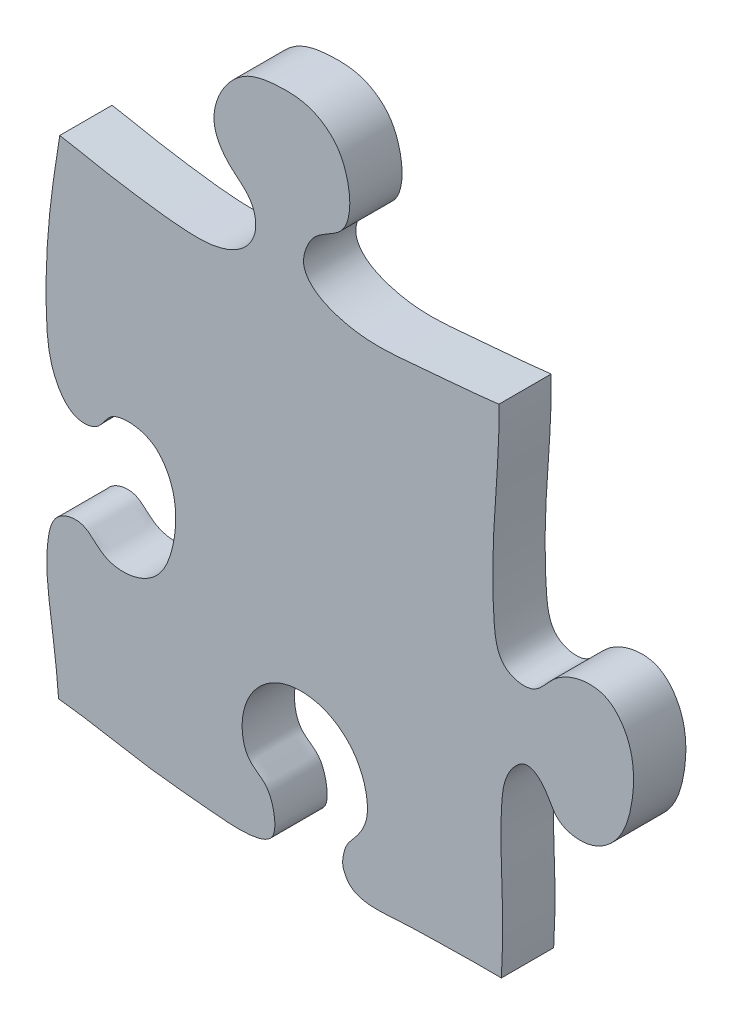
ISO-10303-21;
HEADER;
FILE_DESCRIPTION(('STEP AP214'),'2;1');
FILE_NAME('part.step','',(''),(''),'','','');
FILE_SCHEMA(('AUTOMOTIVE_DESIGN { 1 0 10303 214 1 1 1 1 }'));
ENDSEC;
DATA;
#1=APPLICATION_CONTEXT('core data for automotive mechanical design processes');
#2=APPLICATION_PROTOCOL_DEFINITION('international standard','automotive_design',2000,#1);
#3=PRODUCT_CONTEXT('',#1,'mechanical');
#4=PRODUCT('Part','Part','',(#3));
#5=PRODUCT_RELATED_PRODUCT_CATEGORY('part','',(#4));
#6=PRODUCT_DEFINITION_FORMATION('','',#4);
#7=PRODUCT_DEFINITION_CONTEXT('part definition',#1,'design');
#8=PRODUCT_DEFINITION('design','',#6,#7);
#9=PRODUCT_DEFINITION_SHAPE('','',#8);
#10=(LENGTH_UNIT() NAMED_UNIT(*) SI_UNIT(.MILLI.,.METRE.));
#11=(NAMED_UNIT(*) PLANE_ANGLE_UNIT() SI_UNIT($,.RADIAN.));
#12=(NAMED_UNIT(*) SI_UNIT($,.STERADIAN.) SOLID_ANGLE_UNIT());
#13=UNCERTAINTY_MEASURE_WITH_UNIT(LENGTH_MEASURE(1.E-05),#10,'distance_accuracy_value','');
#14=(GEOMETRIC_REPRESENTATION_CONTEXT(3) GLOBAL_UNCERTAINTY_ASSIGNED_CONTEXT((#13)) GLOBAL_UNIT_ASSIGNED_CONTEXT((#10,
#11,#12)) REPRESENTATION_CONTEXT('',''));
#15=CARTESIAN_POINT('',(0.,0.,0.));
#16=DIRECTION('',(0.,0.,1.));
#17=DIRECTION('',(1.,0.,0.));
#18=AXIS2_PLACEMENT_3D('',#15,#16,#17);
#19=CARTESIAN_POINT('',(325.257058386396,356.,-0.00999999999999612));
#20=CARTESIAN_POINT('',(320.961162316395,345.029410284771,-0.00999999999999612));
#21=CARTESIAN_POINT('',(320.821863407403,330.111228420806,-0.00999999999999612));
#22=CARTESIAN_POINT('',(317.746642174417,310.708405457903,-0.00999999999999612));
#23=CARTESIAN_POINT('',(324.80874526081,302.068845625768,-0.00999999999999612));
#24=CARTESIAN_POINT('',(334.47949844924,301.092198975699,-0.00999999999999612));
#25=CARTESIAN_POINT('',(341.199385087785,308.405018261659,-0.00999999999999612));
#26=CARTESIAN_POINT('',(351.88918877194,310.104343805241,-0.00999999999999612));
#27=CARTESIAN_POINT('',(365.477229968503,308.551893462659,-0.00999999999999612));
#28=CARTESIAN_POINT('',(373.973100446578,293.452904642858,-0.00999999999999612));
#29=CARTESIAN_POINT('',(374.68177629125,275.222888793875,-0.00999999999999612));
#30=CARTESIAN_POINT('',(363.969524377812,260.217712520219,-0.00999999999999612));
#31=CARTESIAN_POINT('',(347.560929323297,258.00994019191,-0.00999999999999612));
#32=CARTESIAN_POINT('',(341.667769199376,269.318092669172,-0.00999999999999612));
#33=CARTESIAN_POINT('',(329.050646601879,268.591464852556,-0.00999999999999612));
#34=CARTESIAN_POINT('',(320.333215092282,258.695380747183,-0.00999999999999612));
#35=CARTESIAN_POINT('',(321.071783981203,237.536716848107,-0.00999999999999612));
#36=CARTESIAN_POINT('',(324.445641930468,214.63289279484,-0.00999999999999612));
#37=CARTESIAN_POINT('',(329.382935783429,185.164436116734,-0.00999999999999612));
#38=CARTESIAN_POINT('',(327.148862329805,151.381238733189,-0.00999999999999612));
#39=CARTESIAN_POINT('',(325.104399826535,122.782989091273,-0.00999999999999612));
#40=CARTESIAN_POINT('',(327.870971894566,95.9027200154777,-0.00999999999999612));
#41=CARTESIAN_POINT('',(342.142457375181,93.3383677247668,-0.00999999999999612));
#42=CARTESIAN_POINT('',(347.900573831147,101.981576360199,-0.00999999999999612));
#43=CARTESIAN_POINT('',(356.834615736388,107.765098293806,-0.00999999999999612));
#44=CARTESIAN_POINT('',(369.379527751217,108.600772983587,-0.00999999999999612));
#45=CARTESIAN_POINT('',(380.120269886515,95.9775166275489,-0.00999999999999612));
#46=CARTESIAN_POINT('',(380.578851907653,78.7451628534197,-0.00999999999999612));
#47=CARTESIAN_POINT('',(375.610818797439,61.7248962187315,-0.00999999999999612));
#48=CARTESIAN_POINT('',(363.715824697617,52.8157722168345,-0.00999999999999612));
#49=CARTESIAN_POINT('',(349.85984979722,55.1705340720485,-0.00999999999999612));
#50=CARTESIAN_POINT('',(346.945856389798,64.810819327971,-0.00999999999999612));
#51=CARTESIAN_POINT('',(338.689797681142,70.9897723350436,-0.00999999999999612));
#52=CARTESIAN_POINT('',(330.580353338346,62.4728514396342,-0.00999999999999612));
#53=CARTESIAN_POINT('',(328.928359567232,48.4436203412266,-0.00999999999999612));
#54=CARTESIAN_POINT('',(329.318852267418,30.6791591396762,-0.00999999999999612));
#55=CARTESIAN_POINT('',(330.266196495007,6.75725364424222,-0.00999999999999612));
#56=CARTESIAN_POINT('',(328.413221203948,-22.8156731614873,-0.00999999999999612));
#57=CARTESIAN_POINT('',(325.957403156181,-47.4645191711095,-0.00999999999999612));
#58=CARTESIAN_POINT('',(324.284943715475,-71.7282942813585,-0.00999999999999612));
#59=CARTESIAN_POINT('',(336.158184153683,-74.5800053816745,-0.00999999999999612));
#60=CARTESIAN_POINT('',(345.605596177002,-70.2479425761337,-0.00999999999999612));
#61=CARTESIAN_POINT('',(352.349142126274,-60.6528291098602,-0.00999999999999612));
#62=CARTESIAN_POINT('',(364.054661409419,-61.084248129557,-0.00999999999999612));
#63=CARTESIAN_POINT('',(376.894401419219,-65.7171784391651,-0.00999999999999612));
#64=CARTESIAN_POINT('',(383.833690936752,-81.7570856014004,-0.00999999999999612));
#65=CARTESIAN_POINT('',(380.385627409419,-99.5380411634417,-0.00999999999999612));
#66=CARTESIAN_POINT('',(369.163029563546,-108.064440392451,-0.00999999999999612));
#67=CARTESIAN_POINT('',(355.487733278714,-112.894616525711,-0.00999999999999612));
#68=CARTESIAN_POINT('',(345.56890588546,-106.804716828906,-0.00999999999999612));
#69=CARTESIAN_POINT('',(337.864154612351,-99.6791187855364,-0.00999999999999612));
#70=CARTESIAN_POINT('',(325.333875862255,-101.340144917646,-0.00999999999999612));
#71=CARTESIAN_POINT('',(326.442256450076,-127.027418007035,-0.00999999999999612));
#72=CARTESIAN_POINT('',(328.990782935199,-147.650339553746,-0.00999999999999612));
#73=CARTESIAN_POINT('',(331.889209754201,-175.720931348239,-0.00999999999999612));
#74=CARTESIAN_POINT('',(333.49389611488,-200.043501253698,-0.00999999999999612));
#75=CARTESIAN_POINT('',(333.062418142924,-222.75850264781,-0.00999999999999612));
#76=CARTESIAN_POINT('',(334.041200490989,-241.335918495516,-0.00999999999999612));
#77=CARTESIAN_POINT('',(324.292862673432,-248.82670983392,-0.00999999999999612));
#78=CARTESIAN_POINT('',(313.862264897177,-249.831348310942,-0.00999999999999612));
#79=CARTESIAN_POINT('',(308.055191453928,-242.821422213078,-0.00999999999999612));
#80=CARTESIAN_POINT('',(300.480173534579,-235.015509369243,-0.00999999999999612));
#81=CARTESIAN_POINT('',(285.021810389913,-234.387092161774,-0.00999999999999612));
#82=CARTESIAN_POINT('',(274.179995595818,-248.432983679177,-0.00999999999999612));
#83=CARTESIAN_POINT('',(270.871780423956,-265.971502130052,-0.00999999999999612));
#84=CARTESIAN_POINT('',(274.212392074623,-284.032454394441,-0.00999999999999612));
#85=CARTESIAN_POINT('',(287.225269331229,-295.05235393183,-0.00999999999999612));
#86=CARTESIAN_POINT('',(300.809811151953,-292.931473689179,-0.00999999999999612));
#87=CARTESIAN_POINT('',(307.364923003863,-284.321305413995,-0.00999999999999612));
#88=CARTESIAN_POINT('',(317.634904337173,-281.646810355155,-0.00999999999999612));
#89=CARTESIAN_POINT('',(335.194502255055,-286.515768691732,-0.00999999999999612));
#90=CARTESIAN_POINT('',(329.900008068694,-321.054322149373,-0.00999999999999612));
#91=CARTESIAN_POINT('',(330.939416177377,-339.80390498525,-0.00999999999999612));
#92=CARTESIAN_POINT('',(328.124742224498,-356.,-0.00999999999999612));
#93=B_SPLINE_CURVE_WITH_KNOTS('',3,(#19,#20,#21,#22,#23,#24,#25,#26,#27,#28,#29,#30,#31,#32,#33,
#34,#35,#36,#37,#38,#39,#40,#41,#42,#43,#44,#45,#46,#47,#48,#49,#50,#51,#52,#53,#54,#55,#56,#57,
#58,#59,#60,#61,#62,#63,#64,#65,#66,#67,#68,#69,#70,#71,#72,#73,#74,#75,#76,#77,#78,#79,#80,#81,
#82,#83,#84,#85,#86,#87,#88,#89,#90,#91,#92),.UNSPECIFIED.,.F.,.F.,(4,1,1,1,1,1,1,1,1,1,1,1,1,1,
1,1,1,1,1,1,1,1,1,1,1,1,1,1,1,1,1,1,1,1,1,1,1,1,1,1,1,1,1,1,1,1,1,1,1,1,1,1,1,1,1,1,1,1,1,1,1,1,
1,1,1,1,1,1,1,1,1,4),(0.,0.0294359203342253,0.0410015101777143,0.0482578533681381,
0.056156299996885,0.0628725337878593,0.0726761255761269,0.0834491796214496,0.0961628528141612,
0.113582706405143,0.1292026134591,0.140393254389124,0.149299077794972,0.1578234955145,
0.168702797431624,0.18034067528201,0.211171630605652,0.230177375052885,0.258218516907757,
0.297936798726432,0.310855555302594,0.319545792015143,0.327782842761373,0.335750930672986,
0.347377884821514,0.35651553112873,0.375682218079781,0.389966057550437,0.401463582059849,
0.411615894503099,0.420595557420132,0.426581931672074,0.43417370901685,0.444880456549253,
0.464136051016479,0.480140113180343,0.507902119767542,0.539252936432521,0.552990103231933,
0.558383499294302,0.567729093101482,0.578921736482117,0.586248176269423,0.596305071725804,
0.613504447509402,0.626237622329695,0.64117705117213,0.647978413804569,0.662971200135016,
0.667795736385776,0.675224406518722,0.689293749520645,0.721613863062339,0.73643728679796,
0.762019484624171,0.785031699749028,0.797726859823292,0.806664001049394,0.814473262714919,
0.822386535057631,0.828765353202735,0.842978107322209,0.855573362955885,0.871677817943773,
0.889062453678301,0.900888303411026,0.912516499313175,0.920249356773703,0.928039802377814,
0.939164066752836,0.961164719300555,1.),.UNSPECIFIED.);
#94=DIRECTION('',(0.,0.,1.));
#95=VECTOR('',#94,1.);
#96=SURFACE_OF_LINEAR_EXTRUSION('',#93,#95);
#97=CARTESIAN_POINT('',(325.257058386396,356.,20.));
#98=CARTESIAN_POINT('',(320.961162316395,345.029410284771,20.));
#99=CARTESIAN_POINT('',(320.821863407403,330.111228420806,20.));
#100=CARTESIAN_POINT('',(317.746642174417,310.708405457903,20.));
#101=CARTESIAN_POINT('',(324.80874526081,302.068845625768,20.));
#102=CARTESIAN_POINT('',(334.47949844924,301.092198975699,20.));
#103=CARTESIAN_POINT('',(341.199385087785,308.405018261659,20.));
#104=CARTESIAN_POINT('',(351.88918877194,310.104343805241,20.));
#105=CARTESIAN_POINT('',(365.477229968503,308.551893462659,20.));
#106=CARTESIAN_POINT('',(373.973100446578,293.452904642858,20.));
#107=CARTESIAN_POINT('',(374.68177629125,275.222888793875,20.));
#108=CARTESIAN_POINT('',(363.969524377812,260.217712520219,20.));
#109=CARTESIAN_POINT('',(347.560929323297,258.00994019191,20.));
#110=CARTESIAN_POINT('',(341.667769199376,269.318092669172,20.));
#111=CARTESIAN_POINT('',(329.050646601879,268.591464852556,20.));
#112=CARTESIAN_POINT('',(320.333215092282,258.695380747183,20.));
#113=CARTESIAN_POINT('',(321.071783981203,237.536716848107,20.));
#114=CARTESIAN_POINT('',(324.445641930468,214.63289279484,20.));
#115=CARTESIAN_POINT('',(329.382935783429,185.164436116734,20.));
#116=CARTESIAN_POINT('',(327.148862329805,151.381238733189,20.));
#117=CARTESIAN_POINT('',(325.104399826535,122.782989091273,20.));
#118=CARTESIAN_POINT('',(327.870971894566,95.9027200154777,20.));
#119=CARTESIAN_POINT('',(342.142457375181,93.3383677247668,20.));
#120=CARTESIAN_POINT('',(347.900573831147,101.981576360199,20.));
#121=CARTESIAN_POINT('',(356.834615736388,107.765098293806,20.));
#122=CARTESIAN_POINT('',(369.379527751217,108.600772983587,20.));
#123=CARTESIAN_POINT('',(380.120269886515,95.9775166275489,20.));
#124=CARTESIAN_POINT('',(380.578851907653,78.7451628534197,20.));
#125=CARTESIAN_POINT('',(375.610818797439,61.7248962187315,20.));
#126=CARTESIAN_POINT('',(363.715824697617,52.8157722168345,20.));
#127=CARTESIAN_POINT('',(349.85984979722,55.1705340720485,20.));
#128=CARTESIAN_POINT('',(346.945856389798,64.810819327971,20.));
#129=CARTESIAN_POINT('',(338.689797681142,70.9897723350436,20.));
#130=CARTESIAN_POINT('',(330.580353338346,62.4728514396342,20.));
#131=CARTESIAN_POINT('',(328.928359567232,48.4436203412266,20.));
#132=CARTESIAN_POINT('',(329.318852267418,30.6791591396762,20.));
#133=CARTESIAN_POINT('',(330.266196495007,6.75725364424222,20.));
#134=CARTESIAN_POINT('',(328.413221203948,-22.8156731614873,20.));
#135=CARTESIAN_POINT('',(325.957403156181,-47.4645191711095,20.));
#136=CARTESIAN_POINT('',(324.284943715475,-71.7282942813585,20.));
#137=CARTESIAN_POINT('',(336.158184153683,-74.5800053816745,20.));
#138=CARTESIAN_POINT('',(345.605596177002,-70.2479425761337,20.));
#139=CARTESIAN_POINT('',(352.349142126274,-60.6528291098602,20.));
#140=CARTESIAN_POINT('',(364.054661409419,-61.084248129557,20.));
#141=CARTESIAN_POINT('',(376.894401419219,-65.7171784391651,20.));
#142=CARTESIAN_POINT('',(383.833690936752,-81.7570856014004,20.));
#143=CARTESIAN_POINT('',(380.385627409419,-99.5380411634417,20.));
#144=CARTESIAN_POINT('',(369.163029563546,-108.064440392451,20.));
#145=CARTESIAN_POINT('',(355.487733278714,-112.894616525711,20.));
#146=CARTESIAN_POINT('',(345.56890588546,-106.804716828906,20.));
#147=CARTESIAN_POINT('',(337.864154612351,-99.6791187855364,20.));
#148=CARTESIAN_POINT('',(325.333875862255,-101.340144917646,20.));
#149=CARTESIAN_POINT('',(326.442256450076,-127.027418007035,20.));
#150=CARTESIAN_POINT('',(328.990782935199,-147.650339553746,20.));
#151=CARTESIAN_POINT('',(331.889209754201,-175.720931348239,20.));
#152=CARTESIAN_POINT('',(333.49389611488,-200.043501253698,20.));
#153=CARTESIAN_POINT('',(333.062418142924,-222.75850264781,20.));
#154=CARTESIAN_POINT('',(334.041200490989,-241.335918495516,20.));
#155=CARTESIAN_POINT('',(324.292862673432,-248.82670983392,20.));
#156=CARTESIAN_POINT('',(313.862264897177,-249.831348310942,20.));
#157=CARTESIAN_POINT('',(308.055191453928,-242.821422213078,20.));
#158=CARTESIAN_POINT('',(300.480173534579,-235.015509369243,20.));
#159=CARTESIAN_POINT('',(285.021810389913,-234.387092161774,20.));
#160=CARTESIAN_POINT('',(274.179995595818,-248.432983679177,20.));
#161=CARTESIAN_POINT('',(270.871780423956,-265.971502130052,20.));
#162=CARTESIAN_POINT('',(274.212392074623,-284.032454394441,20.));
#163=CARTESIAN_POINT('',(287.225269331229,-295.05235393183,20.));
#164=CARTESIAN_POINT('',(300.809811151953,-292.931473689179,20.));
#165=CARTESIAN_POINT('',(307.364923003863,-284.321305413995,20.));
#166=CARTESIAN_POINT('',(317.634904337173,-281.646810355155,20.));
#167=CARTESIAN_POINT('',(335.194502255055,-286.515768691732,20.));
#168=CARTESIAN_POINT('',(329.900008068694,-321.054322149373,20.));
#169=CARTESIAN_POINT('',(330.939416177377,-339.80390498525,20.));
#170=CARTESIAN_POINT('',(328.124742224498,-356.,20.));
#171=B_SPLINE_CURVE_WITH_KNOTS('',3,(#97,#98,#99,#100,#101,#102,#103,#104,#105,#106,#107,#108,
#109,#110,#111,#112,#113,#114,#115,#116,#117,#118,#119,#120,#121,#122,#123,#124,#125,#126,#127,
#128,#129,#130,#131,#132,#133,#134,#135,#136,#137,#138,#139,#140,#141,#142,#143,#144,#145,#146,
#147,#148,#149,#150,#151,#152,#153,#154,#155,#156,#157,#158,#159,#160,#161,#162,#163,#164,#165,
#166,#167,#168,#169,#170),.UNSPECIFIED.,.F.,.F.,(4,1,1,1,1,1,1,1,1,1,1,1,1,1,1,1,1,1,1,1,1,1,1,
1,1,1,1,1,1,1,1,1,1,1,1,1,1,1,1,1,1,1,1,1,1,1,1,1,1,1,1,1,1,1,1,1,1,1,1,1,1,1,1,1,1,1,1,1,1,1,1,
4),(0.,0.0294359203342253,0.0410015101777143,0.0482578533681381,0.056156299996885,
0.0628725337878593,0.0726761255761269,0.0834491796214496,0.0961628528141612,0.113582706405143,
0.1292026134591,0.140393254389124,0.149299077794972,0.1578234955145,0.168702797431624,
0.18034067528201,0.211171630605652,0.230177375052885,0.258218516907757,0.297936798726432,
0.310855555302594,0.319545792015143,0.327782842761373,0.335750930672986,0.347377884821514,
0.35651553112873,0.375682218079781,0.389966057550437,0.401463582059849,0.411615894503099,
0.420595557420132,0.426581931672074,0.43417370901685,0.444880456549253,0.464136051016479,
0.480140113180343,0.507902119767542,0.539252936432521,0.552990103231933,0.558383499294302,
0.567729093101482,0.578921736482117,0.586248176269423,0.596305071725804,0.613504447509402,
0.626237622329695,0.64117705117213,0.647978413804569,0.662971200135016,0.667795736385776,
0.675224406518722,0.689293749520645,0.721613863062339,0.73643728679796,0.762019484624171,
0.785031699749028,0.797726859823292,0.806664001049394,0.814473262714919,0.822386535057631,
0.828765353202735,0.842978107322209,0.855573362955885,0.871677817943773,0.889062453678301,
0.900888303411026,0.912516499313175,0.920249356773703,0.928039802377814,0.939164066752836,
0.961164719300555,1.),.UNSPECIFIED.);
#172=CARTESIAN_POINT('',(328.393413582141,183.083092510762,20.));
#173=VERTEX_POINT('',#172);
#174=CARTESIAN_POINT('',(329.347506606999,-6.46618719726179,20.));
#175=VERTEX_POINT('',#174);
#176=EDGE_CURVE('E38',#173,#175,#171,.T.);
#177=ORIENTED_EDGE('',*,*,#176,.T.);
#178=DIRECTION('',(0.,0.,1.));
#179=VECTOR('',#178,1.);
#180=CARTESIAN_POINT('',(329.347506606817,-6.46618719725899,-0.00999999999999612));
#181=LINE('',#180,#179);
#182=CARTESIAN_POINT('',(329.347506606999,-6.46618719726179,0.));
#183=VERTEX_POINT('',#182);
#184=EDGE_CURVE('E79',#175,#183,#181,.F.);
#185=ORIENTED_EDGE('',*,*,#184,.T.);
#186=CARTESIAN_POINT('',(325.257058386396,356.,0.));
#187=CARTESIAN_POINT('',(320.961162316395,345.029410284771,0.));
#188=CARTESIAN_POINT('',(320.821863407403,330.111228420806,0.));
#189=CARTESIAN_POINT('',(317.746642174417,310.708405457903,0.));
#190=CARTESIAN_POINT('',(324.80874526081,302.068845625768,0.));
#191=CARTESIAN_POINT('',(334.47949844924,301.092198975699,0.));
#192=CARTESIAN_POINT('',(341.199385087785,308.405018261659,0.));
#193=CARTESIAN_POINT('',(351.88918877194,310.104343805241,0.));
#194=CARTESIAN_POINT('',(365.477229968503,308.551893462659,0.));
#195=CARTESIAN_POINT('',(373.973100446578,293.452904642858,0.));
#196=CARTESIAN_POINT('',(374.68177629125,275.222888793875,0.));
#197=CARTESIAN_POINT('',(363.969524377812,260.217712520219,0.));
#198=CARTESIAN_POINT('',(347.560929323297,258.00994019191,0.));
#199=CARTESIAN_POINT('',(341.667769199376,269.318092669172,0.));
#200=CARTESIAN_POINT('',(329.050646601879,268.591464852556,0.));
#201=CARTESIAN_POINT('',(320.333215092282,258.695380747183,0.));
#202=CARTESIAN_POINT('',(321.071783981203,237.536716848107,0.));
#203=CARTESIAN_POINT('',(324.445641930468,214.63289279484,0.));
#204=CARTESIAN_POINT('',(329.382935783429,185.164436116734,0.));
#205=CARTESIAN_POINT('',(327.148862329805,151.381238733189,0.));
#206=CARTESIAN_POINT('',(325.104399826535,122.782989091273,0.));
#207=CARTESIAN_POINT('',(327.870971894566,95.9027200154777,0.));
#208=CARTESIAN_POINT('',(342.142457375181,93.3383677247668,0.));
#209=CARTESIAN_POINT('',(347.900573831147,101.981576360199,0.));
#210=CARTESIAN_POINT('',(356.834615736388,107.765098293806,0.));
#211=CARTESIAN_POINT('',(369.379527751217,108.600772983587,0.));
#212=CARTESIAN_POINT('',(380.120269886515,95.9775166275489,0.));
#213=CARTESIAN_POINT('',(380.578851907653,78.7451628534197,0.));
#214=CARTESIAN_POINT('',(375.610818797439,61.7248962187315,0.));
#215=CARTESIAN_POINT('',(363.715824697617,52.8157722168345,0.));
#216=CARTESIAN_POINT('',(349.85984979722,55.1705340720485,0.));
#217=CARTESIAN_POINT('',(346.945856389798,64.810819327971,0.));
#218=CARTESIAN_POINT('',(338.689797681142,70.9897723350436,0.));
#219=CARTESIAN_POINT('',(330.580353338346,62.4728514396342,0.));
#220=CARTESIAN_POINT('',(328.928359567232,48.4436203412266,0.));
#221=CARTESIAN_POINT('',(329.318852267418,30.6791591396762,0.));
#222=CARTESIAN_POINT('',(330.266196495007,6.75725364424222,0.));
#223=CARTESIAN_POINT('',(328.413221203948,-22.8156731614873,0.));
#224=CARTESIAN_POINT('',(325.957403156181,-47.4645191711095,0.));
#225=CARTESIAN_POINT('',(324.284943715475,-71.7282942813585,0.));
#226=CARTESIAN_POINT('',(336.158184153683,-74.5800053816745,0.));
#227=CARTESIAN_POINT('',(345.605596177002,-70.2479425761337,0.));
#228=CARTESIAN_POINT('',(352.349142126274,-60.6528291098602,0.));
#229=CARTESIAN_POINT('',(364.054661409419,-61.084248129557,0.));
#230=CARTESIAN_POINT('',(376.894401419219,-65.7171784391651,0.));
#231=CARTESIAN_POINT('',(383.833690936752,-81.7570856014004,0.));
#232=CARTESIAN_POINT('',(380.385627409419,-99.5380411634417,0.));
#233=CARTESIAN_POINT('',(369.163029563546,-108.064440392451,0.));
#234=CARTESIAN_POINT('',(355.487733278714,-112.894616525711,0.));
#235=CARTESIAN_POINT('',(345.56890588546,-106.804716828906,0.));
#236=CARTESIAN_POINT('',(337.864154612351,-99.6791187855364,0.));
#237=CARTESIAN_POINT('',(325.333875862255,-101.340144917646,0.));
#238=CARTESIAN_POINT('',(326.442256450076,-127.027418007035,0.));
#239=CARTESIAN_POINT('',(328.990782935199,-147.650339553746,0.));
#240=CARTESIAN_POINT('',(331.889209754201,-175.720931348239,0.));
#241=CARTESIAN_POINT('',(333.49389611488,-200.043501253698,0.));
#242=CARTESIAN_POINT('',(333.062418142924,-222.75850264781,0.));
#243=CARTESIAN_POINT('',(334.041200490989,-241.335918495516,0.));
#244=CARTESIAN_POINT('',(324.292862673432,-248.82670983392,0.));
#245=CARTESIAN_POINT('',(313.862264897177,-249.831348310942,0.));
#246=CARTESIAN_POINT('',(308.055191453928,-242.821422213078,0.));
#247=CARTESIAN_POINT('',(300.480173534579,-235.015509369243,0.));
#248=CARTESIAN_POINT('',(285.021810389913,-234.387092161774,0.));
#249=CARTESIAN_POINT('',(274.179995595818,-248.432983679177,0.));
#250=CARTESIAN_POINT('',(270.871780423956,-265.971502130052,0.));
#251=CARTESIAN_POINT('',(274.212392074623,-284.032454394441,0.));
#252=CARTESIAN_POINT('',(287.225269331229,-295.05235393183,0.));
#253=CARTESIAN_POINT('',(300.809811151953,-292.931473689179,0.));
#254=CARTESIAN_POINT('',(307.364923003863,-284.321305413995,0.));
#255=CARTESIAN_POINT('',(317.634904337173,-281.646810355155,0.));
#256=CARTESIAN_POINT('',(335.194502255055,-286.515768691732,0.));
#257=CARTESIAN_POINT('',(329.900008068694,-321.054322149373,0.));
#258=CARTESIAN_POINT('',(330.939416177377,-339.80390498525,0.));
#259=CARTESIAN_POINT('',(328.124742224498,-356.,0.));
#260=B_SPLINE_CURVE_WITH_KNOTS('',3,(#186,#187,#188,#189,#190,#191,#192,#193,#194,#195,#196,
#197,#198,#199,#200,#201,#202,#203,#204,#205,#206,#207,#208,#209,#210,#211,#212,#213,#214,#215,
#216,#217,#218,#219,#220,#221,#222,#223,#224,#225,#226,#227,#228,#229,#230,#231,#232,#233,#234,
#235,#236,#237,#238,#239,#240,#241,#242,#243,#244,#245,#246,#247,#248,#249,#250,#251,#252,#253,
#254,#255,#256,#257,#258,#259),.UNSPECIFIED.,.F.,.F.,(4,1,1,1,1,1,1,1,1,1,1,1,1,1,1,1,1,1,1,1,1,
1,1,1,1,1,1,1,1,1,1,1,1,1,1,1,1,1,1,1,1,1,1,1,1,1,1,1,1,1,1,1,1,1,1,1,1,1,1,1,1,1,1,1,1,1,1,1,1,
1,1,4),(0.,0.0294359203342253,0.0410015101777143,0.0482578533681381,0.056156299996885,
0.0628725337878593,0.0726761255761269,0.0834491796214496,0.0961628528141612,0.113582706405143,
0.1292026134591,0.140393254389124,0.149299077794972,0.1578234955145,0.168702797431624,
0.18034067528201,0.211171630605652,0.230177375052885,0.258218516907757,0.297936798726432,
0.310855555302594,0.319545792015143,0.327782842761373,0.335750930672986,0.347377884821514,
0.35651553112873,0.375682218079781,0.389966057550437,0.401463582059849,0.411615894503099,
0.420595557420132,0.426581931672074,0.43417370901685,0.444880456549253,0.464136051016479,
0.480140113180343,0.507902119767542,0.539252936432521,0.552990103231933,0.558383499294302,
0.567729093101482,0.578921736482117,0.586248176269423,0.596305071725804,0.613504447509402,
0.626237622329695,0.64117705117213,0.647978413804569,0.662971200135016,0.667795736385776,
0.675224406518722,0.689293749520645,0.721613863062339,0.73643728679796,0.762019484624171,
0.785031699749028,0.797726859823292,0.806664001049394,0.814473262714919,0.822386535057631,
0.828765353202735,0.842978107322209,0.855573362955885,0.871677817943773,0.889062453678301,
0.900888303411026,0.912516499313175,0.920249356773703,0.928039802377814,0.939164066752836,
0.961164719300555,1.),.UNSPECIFIED.);
#261=CARTESIAN_POINT('',(328.393413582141,183.083092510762,0.));
#262=VERTEX_POINT('',#261);
#263=EDGE_CURVE('E121',#262,#183,#260,.T.);
#264=ORIENTED_EDGE('',*,*,#263,.F.);
#265=DIRECTION('',(0.,0.,1.));
#266=VECTOR('',#265,1.);
#267=CARTESIAN_POINT('',(328.393413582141,183.083092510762,-0.00999999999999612));
#268=LINE('',#267,#266);
#269=EDGE_CURVE('E90',#173,#262,#268,.F.);
#270=ORIENTED_EDGE('',*,*,#269,.F.);
#271=EDGE_LOOP('',(#177,#185,#264,#270));
#272=FACE_BOUND('',#271,.T.);
#273=ADVANCED_FACE('F34',(#272),#96,.F.);
#274=CARTESIAN_POINT('',(164.700455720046,356.,-0.00999999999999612));
#275=CARTESIAN_POINT('',(166.684488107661,335.198470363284,-0.00999999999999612));
#276=CARTESIAN_POINT('',(165.501961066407,316.54844325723,-0.00999999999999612));
#277=CARTESIAN_POINT('',(164.960386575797,287.97241381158,-0.00999999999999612));
#278=CARTESIAN_POINT('',(152.647306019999,285.390744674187,-0.00999999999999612));
#279=CARTESIAN_POINT('',(146.755099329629,295.454986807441,-0.00999999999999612));
#280=CARTESIAN_POINT('',(133.057911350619,298.241097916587,-0.00999999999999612));
#281=CARTESIAN_POINT('',(118.543117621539,289.096389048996,-0.00999999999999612));
#282=CARTESIAN_POINT('',(110.066069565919,270.786201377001,-0.00999999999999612));
#283=CARTESIAN_POINT('',(115.81886117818,249.01949577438,-0.00999999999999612));
#284=CARTESIAN_POINT('',(132.43055469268,243.861484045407,-0.00999999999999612));
#285=CARTESIAN_POINT('',(145.190771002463,247.721589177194,-0.00999999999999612));
#286=CARTESIAN_POINT('',(150.073688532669,259.755128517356,-0.00999999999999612));
#287=CARTESIAN_POINT('',(164.873456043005,258.011209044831,-0.00999999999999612));
#288=CARTESIAN_POINT('',(166.852874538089,244.914449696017,-0.00999999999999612));
#289=CARTESIAN_POINT('',(165.64887314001,235.496089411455,-0.00999999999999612));
#290=CARTESIAN_POINT('',(164.287273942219,218.693357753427,-0.00999999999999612));
#291=CARTESIAN_POINT('',(162.190296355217,197.368034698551,-0.00999999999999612));
#292=CARTESIAN_POINT('',(156.3242571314,163.987545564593,-0.00999999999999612));
#293=CARTESIAN_POINT('',(154.411282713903,133.17643128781,-0.00999999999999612));
#294=CARTESIAN_POINT('',(156.534624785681,107.79955112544,-0.00999999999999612));
#295=CARTESIAN_POINT('',(165.683431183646,96.7362595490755,-0.00999999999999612));
#296=CARTESIAN_POINT('',(175.741034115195,97.7165246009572,-0.00999999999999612));
#297=CARTESIAN_POINT('',(178.913476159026,105.433342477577,-0.00999999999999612));
#298=CARTESIAN_POINT('',(187.788546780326,107.088038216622,-0.00999999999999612));
#299=CARTESIAN_POINT('',(196.945345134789,104.662624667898,-0.00999999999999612));
#300=CARTESIAN_POINT('',(205.29981235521,92.5405980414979,-0.00999999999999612));
#301=CARTESIAN_POINT('',(205.41693478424,76.2178133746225,-0.00999999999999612));
#302=CARTESIAN_POINT('',(199.239540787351,59.8870096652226,-0.00999999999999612));
#303=CARTESIAN_POINT('',(186.871281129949,54.774238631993,-0.00999999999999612));
#304=CARTESIAN_POINT('',(176.156697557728,56.844920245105,-0.00999999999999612));
#305=CARTESIAN_POINT('',(170.099360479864,65.2771221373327,-0.00999999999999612));
#306=CARTESIAN_POINT('',(157.970826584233,62.7514417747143,-0.00999999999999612));
#307=CARTESIAN_POINT('',(154.504441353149,46.6972732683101,-0.00999999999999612));
#308=CARTESIAN_POINT('',(156.826886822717,28.5222575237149,-0.00999999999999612));
#309=CARTESIAN_POINT('',(160.951813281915,-0.904965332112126,-0.00999999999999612));
#310=CARTESIAN_POINT('',(160.817443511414,-23.2712614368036,-0.00999999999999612));
#311=CARTESIAN_POINT('',(159.515162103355,-48.5242453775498,-0.00999999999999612));
#312=CARTESIAN_POINT('',(159.855435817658,-66.2012023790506,-0.00999999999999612));
#313=CARTESIAN_POINT('',(174.098925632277,-64.1326131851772,-0.00999999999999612));
#314=CARTESIAN_POINT('',(178.558905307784,-57.1982656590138,-0.00999999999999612));
#315=CARTESIAN_POINT('',(189.170801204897,-53.4758485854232,-0.00999999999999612));
#316=CARTESIAN_POINT('',(204.121791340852,-56.9229006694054,-0.00999999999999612));
#317=CARTESIAN_POINT('',(214.382314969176,-74.3254117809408,-0.00999999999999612));
#318=CARTESIAN_POINT('',(212.434433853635,-94.56819618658,-0.00999999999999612));
#319=CARTESIAN_POINT('',(198.400882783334,-105.927100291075,-0.00999999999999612));
#320=CARTESIAN_POINT('',(183.864051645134,-103.318484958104,-0.00999999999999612));
#321=CARTESIAN_POINT('',(177.484460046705,-92.9196706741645,-0.00999999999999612));
#322=CARTESIAN_POINT('',(166.612136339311,-90.3684772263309,-0.00999999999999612));
#323=CARTESIAN_POINT('',(160.072685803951,-95.573386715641,-0.00999999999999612));
#324=CARTESIAN_POINT('',(159.605088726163,-111.518801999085,-0.00999999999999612));
#325=CARTESIAN_POINT('',(161.971531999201,-132.152629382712,-0.00999999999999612));
#326=CARTESIAN_POINT('',(165.531009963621,-165.300059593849,-0.00999999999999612));
#327=CARTESIAN_POINT('',(167.927544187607,-195.365052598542,-0.00999999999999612));
#328=CARTESIAN_POINT('',(172.57489134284,-240.687787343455,-0.00999999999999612));
#329=CARTESIAN_POINT('',(151.998880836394,-237.677540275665,-0.00999999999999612));
#330=CARTESIAN_POINT('',(144.556929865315,-230.426442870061,-0.00999999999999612));
#331=CARTESIAN_POINT('',(127.822205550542,-229.966972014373,-0.00999999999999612));
#332=CARTESIAN_POINT('',(119.338975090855,-241.300441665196,-0.00999999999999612));
#333=CARTESIAN_POINT('',(116.55363668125,-259.024274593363,-0.00999999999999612));
#334=CARTESIAN_POINT('',(116.920126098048,-276.665079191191,-0.00999999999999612));
#335=CARTESIAN_POINT('',(139.807593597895,-286.808161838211,-0.00999999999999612));
#336=CARTESIAN_POINT('',(149.426451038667,-271.120437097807,-0.00999999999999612));
#337=CARTESIAN_POINT('',(164.833722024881,-276.098774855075,-0.00999999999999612));
#338=CARTESIAN_POINT('',(167.534498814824,-298.611176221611,-0.00999999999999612));
#339=CARTESIAN_POINT('',(167.66539945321,-324.44648435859,-0.00999999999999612));
#340=CARTESIAN_POINT('',(167.206886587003,-345.801767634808,-0.00999999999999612));
#341=CARTESIAN_POINT('',(167.126415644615,-356.,-0.00999999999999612));
#342=B_SPLINE_CURVE_WITH_KNOTS('',3,(#274,#275,#276,#277,#278,#279,#280,#281,#282,#283,#284,
#285,#286,#287,#288,#289,#290,#291,#292,#293,#294,#295,#296,#297,#298,#299,#300,#301,#302,#303,
#304,#305,#306,#307,#308,#309,#310,#311,#312,#313,#314,#315,#316,#317,#318,#319,#320,#321,#322,
#323,#324,#325,#326,#327,#328,#329,#330,#331,#332,#333,#334,#335,#336,#337,#338,#339,#340,#341),
.UNSPECIFIED.,.F.,.F.,(4,1,1,1,1,1,1,1,1,1,1,1,1,1,1,1,1,1,1,1,1,1,1,1,1,1,1,1,1,1,1,1,1,1,1,1,
1,1,1,1,1,1,1,1,1,1,1,1,1,1,1,1,1,1,1,1,1,1,1,1,1,1,1,1,1,4),(0.,0.0528861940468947,
0.0611638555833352,0.0696733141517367,0.078438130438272,0.090018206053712,0.103675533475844,
0.122333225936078,0.142560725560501,0.155895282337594,0.165515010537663,0.176439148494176,
0.187171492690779,0.194785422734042,0.209132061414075,0.213814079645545,0.241605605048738,
0.267229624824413,0.306753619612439,0.326390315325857,0.335466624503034,0.342457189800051,
0.349640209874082,0.355564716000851,0.365339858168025,0.374043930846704,0.393709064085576,
0.408072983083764,0.418687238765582,0.427525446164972,0.43602306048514,0.444515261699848,
0.454494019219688,0.476412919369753,0.496275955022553,0.534624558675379,0.541144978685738,
0.561480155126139,0.567662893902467,0.574392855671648,0.583113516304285,0.596680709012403,
0.612912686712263,0.634082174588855,0.646626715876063,0.657822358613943,0.669754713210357,
0.678210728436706,0.685129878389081,0.689092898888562,0.71784093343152,0.747115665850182,
0.77522808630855,0.815611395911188,0.819725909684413,0.828398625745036,0.84335213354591,
0.85870373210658,0.863219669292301,0.888511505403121,0.901615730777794,0.918667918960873,
0.92637935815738,0.939283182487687,0.973955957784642,1.),.UNSPECIFIED.);
#343=DIRECTION('',(0.,0.,1.));
#344=VECTOR('',#343,1.);
#345=SURFACE_OF_LINEAR_EXTRUSION('',#342,#344);
#346=CARTESIAN_POINT('',(164.700455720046,356.,20.));
#347=CARTESIAN_POINT('',(166.684488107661,335.198470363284,20.));
#348=CARTESIAN_POINT('',(165.501961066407,316.54844325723,20.));
#349=CARTESIAN_POINT('',(164.960386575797,287.97241381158,20.));
#350=CARTESIAN_POINT('',(152.647306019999,285.390744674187,20.));
#351=CARTESIAN_POINT('',(146.755099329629,295.454986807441,20.));
#352=CARTESIAN_POINT('',(133.057911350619,298.241097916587,20.));
#353=CARTESIAN_POINT('',(118.543117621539,289.096389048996,20.));
#354=CARTESIAN_POINT('',(110.066069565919,270.786201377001,20.));
#355=CARTESIAN_POINT('',(115.81886117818,249.01949577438,20.));
#356=CARTESIAN_POINT('',(132.43055469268,243.861484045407,20.));
#357=CARTESIAN_POINT('',(145.190771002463,247.721589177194,20.));
#358=CARTESIAN_POINT('',(150.073688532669,259.755128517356,20.));
#359=CARTESIAN_POINT('',(164.873456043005,258.011209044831,20.));
#360=CARTESIAN_POINT('',(166.852874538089,244.914449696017,20.));
#361=CARTESIAN_POINT('',(165.64887314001,235.496089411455,20.));
#362=CARTESIAN_POINT('',(164.287273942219,218.693357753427,20.));
#363=CARTESIAN_POINT('',(162.190296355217,197.368034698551,20.));
#364=CARTESIAN_POINT('',(156.3242571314,163.987545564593,20.));
#365=CARTESIAN_POINT('',(154.411282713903,133.17643128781,20.));
#366=CARTESIAN_POINT('',(156.534624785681,107.79955112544,20.));
#367=CARTESIAN_POINT('',(165.683431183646,96.7362595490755,20.));
#368=CARTESIAN_POINT('',(175.741034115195,97.7165246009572,20.));
#369=CARTESIAN_POINT('',(178.913476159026,105.433342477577,20.));
#370=CARTESIAN_POINT('',(187.788546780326,107.088038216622,20.));
#371=CARTESIAN_POINT('',(196.945345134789,104.662624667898,20.));
#372=CARTESIAN_POINT('',(205.29981235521,92.5405980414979,20.));
#373=CARTESIAN_POINT('',(205.41693478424,76.2178133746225,20.));
#374=CARTESIAN_POINT('',(199.239540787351,59.8870096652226,20.));
#375=CARTESIAN_POINT('',(186.871281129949,54.774238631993,20.));
#376=CARTESIAN_POINT('',(176.156697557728,56.844920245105,20.));
#377=CARTESIAN_POINT('',(170.099360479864,65.2771221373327,20.));
#378=CARTESIAN_POINT('',(157.970826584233,62.7514417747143,20.));
#379=CARTESIAN_POINT('',(154.504441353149,46.6972732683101,20.));
#380=CARTESIAN_POINT('',(156.826886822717,28.5222575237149,20.));
#381=CARTESIAN_POINT('',(160.951813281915,-0.904965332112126,20.));
#382=CARTESIAN_POINT('',(160.817443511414,-23.2712614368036,20.));
#383=CARTESIAN_POINT('',(159.515162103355,-48.5242453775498,20.));
#384=CARTESIAN_POINT('',(159.855435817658,-66.2012023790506,20.));
#385=CARTESIAN_POINT('',(174.098925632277,-64.1326131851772,20.));
#386=CARTESIAN_POINT('',(178.558905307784,-57.1982656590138,20.));
#387=CARTESIAN_POINT('',(189.170801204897,-53.4758485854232,20.));
#388=CARTESIAN_POINT('',(204.121791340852,-56.9229006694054,20.));
#389=CARTESIAN_POINT('',(214.382314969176,-74.3254117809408,20.));
#390=CARTESIAN_POINT('',(212.434433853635,-94.56819618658,20.));
#391=CARTESIAN_POINT('',(198.400882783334,-105.927100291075,20.));
#392=CARTESIAN_POINT('',(183.864051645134,-103.318484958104,20.));
#393=CARTESIAN_POINT('',(177.484460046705,-92.9196706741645,20.));
#394=CARTESIAN_POINT('',(166.612136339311,-90.3684772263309,20.));
#395=CARTESIAN_POINT('',(160.072685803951,-95.573386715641,20.));
#396=CARTESIAN_POINT('',(159.605088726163,-111.518801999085,20.));
#397=CARTESIAN_POINT('',(161.971531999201,-132.152629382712,20.));
#398=CARTESIAN_POINT('',(165.531009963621,-165.300059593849,20.));
#399=CARTESIAN_POINT('',(167.927544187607,-195.365052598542,20.));
#400=CARTESIAN_POINT('',(172.57489134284,-240.687787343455,20.));
#401=CARTESIAN_POINT('',(151.998880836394,-237.677540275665,20.));
#402=CARTESIAN_POINT('',(144.556929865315,-230.426442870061,20.));
#403=CARTESIAN_POINT('',(127.822205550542,-229.966972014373,20.));
#404=CARTESIAN_POINT('',(119.338975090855,-241.300441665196,20.));
#405=CARTESIAN_POINT('',(116.55363668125,-259.024274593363,20.));
#406=CARTESIAN_POINT('',(116.920126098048,-276.665079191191,20.));
#407=CARTESIAN_POINT('',(139.807593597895,-286.808161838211,20.));
#408=CARTESIAN_POINT('',(149.426451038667,-271.120437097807,20.));
#409=CARTESIAN_POINT('',(164.833722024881,-276.098774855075,20.));
#410=CARTESIAN_POINT('',(167.534498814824,-298.611176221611,20.));
#411=CARTESIAN_POINT('',(167.66539945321,-324.44648435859,20.));
#412=CARTESIAN_POINT('',(167.206886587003,-345.801767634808,20.));
#413=CARTESIAN_POINT('',(167.126415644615,-356.,20.));
#414=B_SPLINE_CURVE_WITH_KNOTS('',3,(#346,#347,#348,#349,#350,#351,#352,#353,#354,#355,#356,
#357,#358,#359,#360,#361,#362,#363,#364,#365,#366,#367,#368,#369,#370,#371,#372,#373,#374,#375,
#376,#377,#378,#379,#380,#381,#382,#383,#384,#385,#386,#387,#388,#389,#390,#391,#392,#393,#394,
#395,#396,#397,#398,#399,#400,#401,#402,#403,#404,#405,#406,#407,#408,#409,#410,#411,#412,#413),
.UNSPECIFIED.,.F.,.F.,(4,1,1,1,1,1,1,1,1,1,1,1,1,1,1,1,1,1,1,1,1,1,1,1,1,1,1,1,1,1,1,1,1,1,1,1,
1,1,1,1,1,1,1,1,1,1,1,1,1,1,1,1,1,1,1,1,1,1,1,1,1,1,1,1,1,4),(0.,0.0528861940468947,
0.0611638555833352,0.0696733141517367,0.078438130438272,0.090018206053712,0.103675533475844,
0.122333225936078,0.142560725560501,0.155895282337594,0.165515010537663,0.176439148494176,
0.187171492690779,0.194785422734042,0.209132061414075,0.213814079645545,0.241605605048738,
0.267229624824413,0.306753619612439,0.326390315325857,0.335466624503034,0.342457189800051,
0.349640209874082,0.355564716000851,0.365339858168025,0.374043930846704,0.393709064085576,
0.408072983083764,0.418687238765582,0.427525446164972,0.43602306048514,0.444515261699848,
0.454494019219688,0.476412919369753,0.496275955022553,0.534624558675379,0.541144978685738,
0.561480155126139,0.567662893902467,0.574392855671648,0.583113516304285,0.596680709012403,
0.612912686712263,0.634082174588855,0.646626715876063,0.657822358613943,0.669754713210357,
0.678210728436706,0.685129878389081,0.689092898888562,0.71784093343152,0.747115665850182,
0.77522808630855,0.815611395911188,0.819725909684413,0.828398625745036,0.84335213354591,
0.85870373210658,0.863219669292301,0.888511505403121,0.901615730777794,0.918667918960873,
0.92637935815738,0.939283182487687,0.973955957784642,1.),.UNSPECIFIED.);
#415=CARTESIAN_POINT('',(160.461892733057,188.122695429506,20.));
#416=VERTEX_POINT('',#415);
#417=CARTESIAN_POINT('',(160.020895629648,1.33334492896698,20.));
#418=VERTEX_POINT('',#417);
#419=EDGE_CURVE('E53',#416,#418,#414,.T.);
#420=ORIENTED_EDGE('',*,*,#419,.F.);
#421=DIRECTION('',(0.,0.,1.));
#422=VECTOR('',#421,1.);
#423=CARTESIAN_POINT('',(160.461892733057,188.122695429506,-0.00999999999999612));
#424=LINE('',#423,#422);
#425=CARTESIAN_POINT('',(160.461892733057,188.122695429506,0.));
#426=VERTEX_POINT('',#425);
#427=EDGE_CURVE('E86',#416,#426,#424,.F.);
#428=ORIENTED_EDGE('',*,*,#427,.T.);
#429=CARTESIAN_POINT('',(164.700455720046,356.,0.));
#430=CARTESIAN_POINT('',(166.684488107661,335.198470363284,0.));
#431=CARTESIAN_POINT('',(165.501961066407,316.54844325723,0.));
#432=CARTESIAN_POINT('',(164.960386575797,287.97241381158,0.));
#433=CARTESIAN_POINT('',(152.647306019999,285.390744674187,0.));
#434=CARTESIAN_POINT('',(146.755099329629,295.454986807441,0.));
#435=CARTESIAN_POINT('',(133.057911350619,298.241097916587,0.));
#436=CARTESIAN_POINT('',(118.543117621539,289.096389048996,0.));
#437=CARTESIAN_POINT('',(110.066069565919,270.786201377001,0.));
#438=CARTESIAN_POINT('',(115.81886117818,249.01949577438,0.));
#439=CARTESIAN_POINT('',(132.43055469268,243.861484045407,0.));
#440=CARTESIAN_POINT('',(145.190771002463,247.721589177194,0.));
#441=CARTESIAN_POINT('',(150.073688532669,259.755128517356,0.));
#442=CARTESIAN_POINT('',(164.873456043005,258.011209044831,0.));
#443=CARTESIAN_POINT('',(166.852874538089,244.914449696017,0.));
#444=CARTESIAN_POINT('',(165.64887314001,235.496089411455,0.));
#445=CARTESIAN_POINT('',(164.287273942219,218.693357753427,0.));
#446=CARTESIAN_POINT('',(162.190296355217,197.368034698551,0.));
#447=CARTESIAN_POINT('',(156.3242571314,163.987545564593,0.));
#448=CARTESIAN_POINT('',(154.411282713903,133.17643128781,0.));
#449=CARTESIAN_POINT('',(156.534624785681,107.79955112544,0.));
#450=CARTESIAN_POINT('',(165.683431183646,96.7362595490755,0.));
#451=CARTESIAN_POINT('',(175.741034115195,97.7165246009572,0.));
#452=CARTESIAN_POINT('',(178.913476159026,105.433342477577,0.));
#453=CARTESIAN_POINT('',(187.788546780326,107.088038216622,0.));
#454=CARTESIAN_POINT('',(196.945345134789,104.662624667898,0.));
#455=CARTESIAN_POINT('',(205.29981235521,92.5405980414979,0.));
#456=CARTESIAN_POINT('',(205.41693478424,76.2178133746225,0.));
#457=CARTESIAN_POINT('',(199.239540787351,59.8870096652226,0.));
#458=CARTESIAN_POINT('',(186.871281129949,54.774238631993,0.));
#459=CARTESIAN_POINT('',(176.156697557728,56.844920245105,0.));
#460=CARTESIAN_POINT('',(170.099360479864,65.2771221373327,0.));
#461=CARTESIAN_POINT('',(157.970826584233,62.7514417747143,0.));
#462=CARTESIAN_POINT('',(154.504441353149,46.6972732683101,0.));
#463=CARTESIAN_POINT('',(156.826886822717,28.5222575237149,0.));
#464=CARTESIAN_POINT('',(160.951813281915,-0.904965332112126,0.));
#465=CARTESIAN_POINT('',(160.817443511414,-23.2712614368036,0.));
#466=CARTESIAN_POINT('',(159.515162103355,-48.5242453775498,0.));
#467=CARTESIAN_POINT('',(159.855435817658,-66.2012023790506,0.));
#468=CARTESIAN_POINT('',(174.098925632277,-64.1326131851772,0.));
#469=CARTESIAN_POINT('',(178.558905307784,-57.1982656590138,0.));
#470=CARTESIAN_POINT('',(189.170801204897,-53.4758485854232,0.));
#471=CARTESIAN_POINT('',(204.121791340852,-56.9229006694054,0.));
#472=CARTESIAN_POINT('',(214.382314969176,-74.3254117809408,0.));
#473=CARTESIAN_POINT('',(212.434433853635,-94.56819618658,0.));
#474=CARTESIAN_POINT('',(198.400882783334,-105.927100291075,0.));
#475=CARTESIAN_POINT('',(183.864051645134,-103.318484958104,0.));
#476=CARTESIAN_POINT('',(177.484460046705,-92.9196706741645,0.));
#477=CARTESIAN_POINT('',(166.612136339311,-90.3684772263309,0.));
#478=CARTESIAN_POINT('',(160.072685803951,-95.573386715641,0.));
#479=CARTESIAN_POINT('',(159.605088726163,-111.518801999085,0.));
#480=CARTESIAN_POINT('',(161.971531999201,-132.152629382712,0.));
#481=CARTESIAN_POINT('',(165.531009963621,-165.300059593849,0.));
#482=CARTESIAN_POINT('',(167.927544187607,-195.365052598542,0.));
#483=CARTESIAN_POINT('',(172.57489134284,-240.687787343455,0.));
#484=CARTESIAN_POINT('',(151.998880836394,-237.677540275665,0.));
#485=CARTESIAN_POINT('',(144.556929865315,-230.426442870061,0.));
#486=CARTESIAN_POINT('',(127.822205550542,-229.966972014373,0.));
#487=CARTESIAN_POINT('',(119.338975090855,-241.300441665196,0.));
#488=CARTESIAN_POINT('',(116.55363668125,-259.024274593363,0.));
#489=CARTESIAN_POINT('',(116.920126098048,-276.665079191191,0.));
#490=CARTESIAN_POINT('',(139.807593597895,-286.808161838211,0.));
#491=CARTESIAN_POINT('',(149.426451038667,-271.120437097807,0.));
#492=CARTESIAN_POINT('',(164.833722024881,-276.098774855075,0.));
#493=CARTESIAN_POINT('',(167.534498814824,-298.611176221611,0.));
#494=CARTESIAN_POINT('',(167.66539945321,-324.44648435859,0.));
#495=CARTESIAN_POINT('',(167.206886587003,-345.801767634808,0.));
#496=CARTESIAN_POINT('',(167.126415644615,-356.,0.));
#497=B_SPLINE_CURVE_WITH_KNOTS('',3,(#429,#430,#431,#432,#433,#434,#435,#436,#437,#438,#439,
#440,#441,#442,#443,#444,#445,#446,#447,#448,#449,#450,#451,#452,#453,#454,#455,#456,#457,#458,
#459,#460,#461,#462,#463,#464,#465,#466,#467,#468,#469,#470,#471,#472,#473,#474,#475,#476,#477,
#478,#479,#480,#481,#482,#483,#484,#485,#486,#487,#488,#489,#490,#491,#492,#493,#494,#495,#496),
.UNSPECIFIED.,.F.,.F.,(4,1,1,1,1,1,1,1,1,1,1,1,1,1,1,1,1,1,1,1,1,1,1,1,1,1,1,1,1,1,1,1,1,1,1,1,
1,1,1,1,1,1,1,1,1,1,1,1,1,1,1,1,1,1,1,1,1,1,1,1,1,1,1,1,1,4),(0.,0.0528861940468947,
0.0611638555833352,0.0696733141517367,0.078438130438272,0.090018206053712,0.103675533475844,
0.122333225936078,0.142560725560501,0.155895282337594,0.165515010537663,0.176439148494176,
0.187171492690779,0.194785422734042,0.209132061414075,0.213814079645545,0.241605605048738,
0.267229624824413,0.306753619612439,0.326390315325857,0.335466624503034,0.342457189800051,
0.349640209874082,0.355564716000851,0.365339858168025,0.374043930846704,0.393709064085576,
0.408072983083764,0.418687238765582,0.427525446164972,0.43602306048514,0.444515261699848,
0.454494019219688,0.476412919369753,0.496275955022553,0.534624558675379,0.541144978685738,
0.561480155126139,0.567662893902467,0.574392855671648,0.583113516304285,0.596680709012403,
0.612912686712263,0.634082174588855,0.646626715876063,0.657822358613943,0.669754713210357,
0.678210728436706,0.685129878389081,0.689092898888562,0.71784093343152,0.747115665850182,
0.77522808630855,0.815611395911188,0.819725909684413,0.828398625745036,0.84335213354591,
0.85870373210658,0.863219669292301,0.888511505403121,0.901615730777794,0.918667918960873,
0.92637935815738,0.939283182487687,0.973955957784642,1.),.UNSPECIFIED.);
#498=CARTESIAN_POINT('',(160.020895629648,1.33334492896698,0.));
#499=VERTEX_POINT('',#498);
#500=EDGE_CURVE('E87',#426,#499,#497,.T.);
#501=ORIENTED_EDGE('',*,*,#500,.T.);
#502=DIRECTION('',(0.,0.,1.));
#503=VECTOR('',#502,1.);
#504=CARTESIAN_POINT('',(160.020895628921,1.33334492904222,-0.00999999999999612));
#505=LINE('',#504,#503);
#506=EDGE_CURVE('E119',#418,#499,#505,.F.);
#507=ORIENTED_EDGE('',*,*,#506,.F.);
#508=EDGE_LOOP('',(#420,#428,#501,#507));
#509=FACE_BOUND('',#508,.T.);
#510=ADVANCED_FACE('F118',(#509),#345,.T.);
#511=CARTESIAN_POINT('',(-349.139880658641,5.30046994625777,-0.00999999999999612));
#512=CARTESIAN_POINT('',(-339.887860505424,5.11479546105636,-0.00999999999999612));
#513=CARTESIAN_POINT('',(-319.891606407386,5.70075392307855,-0.00999999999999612));
#514=CARTESIAN_POINT('',(-312.057252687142,6.39377361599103,-0.00999999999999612));
#515=CARTESIAN_POINT('',(-295.557040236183,6.5821024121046,-0.00999999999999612));
#516=CARTESIAN_POINT('',(-287.520649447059,5.38238329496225,-0.00999999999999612));
#517=CARTESIAN_POINT('',(-282.231232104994,-0.739375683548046,-0.00999999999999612));
#518=CARTESIAN_POINT('',(-284.631758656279,-6.70157001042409,-0.00999999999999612));
#519=CARTESIAN_POINT('',(-290.291633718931,-11.4270553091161,-0.00999999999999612));
#520=CARTESIAN_POINT('',(-294.264404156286,-19.1154923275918,-0.00999999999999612));
#521=CARTESIAN_POINT('',(-294.324045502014,-31.0075730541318,-0.00999999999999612));
#522=CARTESIAN_POINT('',(-285.696757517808,-42.2618535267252,-0.00999999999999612));
#523=CARTESIAN_POINT('',(-271.389959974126,-47.4058055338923,-0.00999999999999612));
#524=CARTESIAN_POINT('',(-259.358947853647,-47.5927514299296,-0.00999999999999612));
#525=CARTESIAN_POINT('',(-248.949507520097,-41.269541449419,-0.00999999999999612));
#526=CARTESIAN_POINT('',(-243.879910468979,-32.2576865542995,-0.00999999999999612));
#527=CARTESIAN_POINT('',(-242.928014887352,-21.7896256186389,-0.00999999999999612));
#528=CARTESIAN_POINT('',(-249.227477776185,-14.851631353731,-0.00999999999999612));
#529=CARTESIAN_POINT('',(-254.593465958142,-9.43942563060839,-0.00999999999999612));
#530=CARTESIAN_POINT('',(-258.137345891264,-1.50662300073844,-0.00999999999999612));
#531=CARTESIAN_POINT('',(-253.898534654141,5.55474508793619,-0.00999999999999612));
#532=CARTESIAN_POINT('',(-243.567188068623,7.43755302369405,-0.00999999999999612));
#533=CARTESIAN_POINT('',(-237.879490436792,6.8669695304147,-0.00999999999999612));
#534=CARTESIAN_POINT('',(-212.535663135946,4.31355413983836,-0.00999999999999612));
#535=CARTESIAN_POINT('',(-204.857637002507,3.06770049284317,-0.00999999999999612));
#536=CARTESIAN_POINT('',(-187.870824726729,0.576823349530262,-0.00999999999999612));
#537=CARTESIAN_POINT('',(-180.873341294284,-0.585089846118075,-0.00999999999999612));
#538=CARTESIAN_POINT('',(-167.321297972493,-4.05861827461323,-0.00999999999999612));
#539=CARTESIAN_POINT('',(-158.264072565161,-5.81322262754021,-0.00999999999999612));
#540=CARTESIAN_POINT('',(-139.329328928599,-8.34288673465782,-0.00999999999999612));
#541=CARTESIAN_POINT('',(-132.040798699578,-2.9845391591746,-0.00999999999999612));
#542=CARTESIAN_POINT('',(-129.761885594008,4.23046807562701,-0.00999999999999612));
#543=CARTESIAN_POINT('',(-131.710784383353,10.4013258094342,-0.00999999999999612));
#544=CARTESIAN_POINT('',(-133.710968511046,14.6601816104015,-0.00999999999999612));
#545=CARTESIAN_POINT('',(-138.026269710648,21.724753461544,-0.00999999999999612));
#546=CARTESIAN_POINT('',(-138.081917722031,32.3728530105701,-0.00999999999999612));
#547=CARTESIAN_POINT('',(-131.83570692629,43.0815337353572,-0.00999999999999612));
#548=CARTESIAN_POINT('',(-119.794248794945,47.304204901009,-0.00999999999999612));
#549=CARTESIAN_POINT('',(-108.957899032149,47.5382470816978,-0.00999999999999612));
#550=CARTESIAN_POINT('',(-96.8719484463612,45.7015776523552,-0.00999999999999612));
#551=CARTESIAN_POINT('',(-87.0853124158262,37.0457421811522,-0.00999999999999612));
#552=CARTESIAN_POINT('',(-87.3806461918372,25.6113797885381,-0.00999999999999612));
#553=CARTESIAN_POINT('',(-91.1138584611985,18.4470720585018,-0.00999999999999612));
#554=CARTESIAN_POINT('',(-96.1690771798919,13.9582424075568,-0.00999999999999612));
#555=CARTESIAN_POINT('',(-97.7539111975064,6.63580226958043,-0.00999999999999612));
#556=CARTESIAN_POINT('',(-93.1531213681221,0.225805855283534,-0.00999999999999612));
#557=CARTESIAN_POINT('',(-85.7868945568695,-4.22125029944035,-0.00999999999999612));
#558=CARTESIAN_POINT('',(-75.4922823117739,-4.72742713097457,-0.00999999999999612));
#559=CARTESIAN_POINT('',(-63.6021774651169,-3.739894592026,-0.00999999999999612));
#560=CARTESIAN_POINT('',(-47.1576847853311,-2.15281130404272,-0.00999999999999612));
#561=CARTESIAN_POINT('',(-35.4735305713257,-1.02782701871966,-0.00999999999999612));
#562=CARTESIAN_POINT('',(-9.55974097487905,5.44923466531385,-0.00999999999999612));
#563=CARTESIAN_POINT('',(5.33335319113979,5.64341864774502,-0.00999999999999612));
#564=CARTESIAN_POINT('',(26.8877087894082,6.61154693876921,-0.00999999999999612));
#565=CARTESIAN_POINT('',(40.3616385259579,6.66752296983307,-0.00999999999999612));
#566=CARTESIAN_POINT('',(55.4069140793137,6.55682515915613,-0.00999999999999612));
#567=CARTESIAN_POINT('',(60.9823316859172,-1.76204700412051,-0.00999999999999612));
#568=CARTESIAN_POINT('',(62.7286219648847,-10.7101888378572,-0.00999999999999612));
#569=CARTESIAN_POINT('',(58.0719160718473,-18.2162229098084,-0.00999999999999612));
#570=CARTESIAN_POINT('',(50.4934538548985,-22.6369036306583,-0.00999999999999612));
#571=CARTESIAN_POINT('',(49.5191525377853,-32.4601424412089,-0.00999999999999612));
#572=CARTESIAN_POINT('',(50.9102608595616,-43.3041677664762,-0.00999999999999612));
#573=CARTESIAN_POINT('',(60.9494806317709,-51.7611152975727,-0.00999999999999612));
#574=CARTESIAN_POINT('',(73.8438777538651,-54.9427485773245,-0.00999999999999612));
#575=CARTESIAN_POINT('',(86.4324503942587,-54.0451489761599,-0.00999999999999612));
#576=CARTESIAN_POINT('',(96.2763408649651,-49.8211627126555,-0.00999999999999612));
#577=CARTESIAN_POINT('',(101.788676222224,-42.6926438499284,-0.00999999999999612));
#578=CARTESIAN_POINT('',(103.785622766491,-33.9307441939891,-0.00999999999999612));
#579=CARTESIAN_POINT('',(101.793989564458,-26.0744158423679,-0.00999999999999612));
#580=CARTESIAN_POINT('',(95.2302198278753,-18.82812621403,-0.00999999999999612));
#581=CARTESIAN_POINT('',(89.6165079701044,-10.8535457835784,-0.00999999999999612));
#582=CARTESIAN_POINT('',(88.5833289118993,0.119561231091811,-0.00999999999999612));
#583=CARTESIAN_POINT('',(98.1406475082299,6.80161389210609,-0.00999999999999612));
#584=CARTESIAN_POINT('',(110.075702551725,4.83412068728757,-0.00999999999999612));
#585=CARTESIAN_POINT('',(121.713926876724,4.79342247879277,-0.00999999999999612));
#586=CARTESIAN_POINT('',(136.161134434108,3.20442078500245,-0.00999999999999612));
#587=CARTESIAN_POINT('',(149.301551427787,2.24618232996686,-0.00999999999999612));
#588=CARTESIAN_POINT('',(163.635697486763,1.11607382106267,-0.00999999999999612));
#589=CARTESIAN_POINT('',(175.743984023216,-0.930199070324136,-0.00999999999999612));
#590=CARTESIAN_POINT('',(193.50042565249,-4.03526402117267,-0.00999999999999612));
#591=CARTESIAN_POINT('',(199.307125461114,-4.82007249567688,-0.00999999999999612));
#592=CARTESIAN_POINT('',(223.191668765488,-7.20796265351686,-0.00999999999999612));
#593=CARTESIAN_POINT('',(234.005762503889,-7.89583073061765,-0.00999999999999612));
#594=CARTESIAN_POINT('',(243.165304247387,-4.21144732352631,-0.00999999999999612));
#595=CARTESIAN_POINT('',(242.728227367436,5.29385628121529,-0.00999999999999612));
#596=CARTESIAN_POINT('',(239.691190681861,13.3923508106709,-0.00999999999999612));
#597=CARTESIAN_POINT('',(230.992924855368,17.259551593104,-0.00999999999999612));
#598=CARTESIAN_POINT('',(228.562234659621,35.6530691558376,-0.00999999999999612));
#599=CARTESIAN_POINT('',(241.485133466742,51.1639498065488,-0.00999999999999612));
#600=CARTESIAN_POINT('',(261.294428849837,50.4989765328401,-0.00999999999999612));
#601=CARTESIAN_POINT('',(273.311157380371,41.2796485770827,-0.00999999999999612));
#602=CARTESIAN_POINT('',(278.244185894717,29.7939334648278,-0.00999999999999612));
#603=CARTESIAN_POINT('',(278.46311043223,19.1716807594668,-0.00999999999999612));
#604=CARTESIAN_POINT('',(273.41239647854,11.7823053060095,-0.00999999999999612));
#605=CARTESIAN_POINT('',(269.462797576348,8.07180362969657,-0.00999999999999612));
#606=CARTESIAN_POINT('',(268.275297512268,1.27447756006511,-0.00999999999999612));
#607=CARTESIAN_POINT('',(269.56536006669,-2.1294813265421,-0.00999999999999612));
#608=CARTESIAN_POINT('',(273.239630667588,-8.77034024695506,-0.00999999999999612));
#609=CARTESIAN_POINT('',(289.550418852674,-6.96961632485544,-0.00999999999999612));
#610=CARTESIAN_POINT('',(304.280714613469,-6.71047567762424,-0.00999999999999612));
#611=CARTESIAN_POINT('',(324.326281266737,-6.23084088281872,-0.00999999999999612));
#612=CARTESIAN_POINT('',(349.235083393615,-7.00547217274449,-0.00999999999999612));
#613=CARTESIAN_POINT('',(375.517421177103,-8.89168640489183,-0.00999999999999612));
#614=CARTESIAN_POINT('',(398.91687007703,-8.79198570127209,-0.00999999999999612));
#615=CARTESIAN_POINT('',(415.173568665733,-7.26147865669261,-0.00999999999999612));
#616=CARTESIAN_POINT('',(418.590464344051,2.48372200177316,-0.00999999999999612));
#617=CARTESIAN_POINT('',(414.376255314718,7.33198876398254,-0.00999999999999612));
#618=CARTESIAN_POINT('',(409.420059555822,12.1922927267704,-0.00999999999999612));
#619=CARTESIAN_POINT('',(403.982345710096,21.0196469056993,-0.00999999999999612));
#620=CARTESIAN_POINT('',(405.486454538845,34.4252863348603,-0.00999999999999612));
#621=CARTESIAN_POINT('',(417.292648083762,42.4744659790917,-0.00999999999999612));
#622=CARTESIAN_POINT('',(430.971964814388,44.2079105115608,-0.00999999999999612));
#623=CARTESIAN_POINT('',(444.367703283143,42.5130395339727,-0.00999999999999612));
#624=CARTESIAN_POINT('',(452.635026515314,34.8362400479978,-0.00999999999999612));
#625=CARTESIAN_POINT('',(459.310429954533,27.5027807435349,-0.00999999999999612));
#626=CARTESIAN_POINT('',(458.249050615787,18.2902890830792,-0.00999999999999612));
#627=CARTESIAN_POINT('',(455.302955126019,10.0877891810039,-0.00999999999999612));
#628=CARTESIAN_POINT('',(448.406360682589,8.30941704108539,-0.00999999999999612));
#629=CARTESIAN_POINT('',(446.811865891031,2.1759580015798,-0.00999999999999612));
#630=CARTESIAN_POINT('',(451.102211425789,-2.40101244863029,-0.00999999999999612));
#631=CARTESIAN_POINT('',(456.533203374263,-6.13416812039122,-0.00999999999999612));
#632=CARTESIAN_POINT('',(468.262453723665,-6.69921981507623,-0.00999999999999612));
#633=CARTESIAN_POINT('',(486.320062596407,-6.06999038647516,-0.00999999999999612));
#634=CARTESIAN_POINT('',(502.630044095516,-5.50396307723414,-0.00999999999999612));
#635=CARTESIAN_POINT('',(512.,-5.81701820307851,-0.00999999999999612));
#636=B_SPLINE_CURVE_WITH_KNOTS('',3,(#511,#512,#513,#514,#515,#516,#517,#518,#519,#520,#521,
#522,#523,#524,#525,#526,#527,#528,#529,#530,#531,#532,#533,#534,#535,#536,#537,#538,#539,#540,
#541,#542,#543,#544,#545,#546,#547,#548,#549,#550,#551,#552,#553,#554,#555,#556,#557,#558,#559,
#560,#561,#562,#563,#564,#565,#566,#567,#568,#569,#570,#571,#572,#573,#574,#575,#576,#577,#578,
#579,#580,#581,#582,#583,#584,#585,#586,#587,#588,#589,#590,#591,#592,#593,#594,#595,#596,#597,
#598,#599,#600,#601,#602,#603,#604,#605,#606,#607,#608,#609,#610,#611,#612,#613,#614,#615,#616,
#617,#618,#619,#620,#621,#622,#623,#624,#625,#626,#627,#628,#629,#630,#631,#632,#633,#634,#635),
.UNSPECIFIED.,.F.,.F.,(4,1,1,1,1,1,1,1,1,1,1,1,1,1,1,1,1,1,1,1,1,1,1,1,1,1,1,1,1,1,1,1,1,1,1,1,
1,1,1,1,1,1,1,1,1,1,1,1,1,1,1,1,1,1,1,1,1,1,1,1,1,1,1,1,1,1,1,1,1,1,1,1,1,1,1,1,1,1,1,1,1,1,1,1,
1,1,1,1,1,1,1,1,1,1,1,1,1,1,1,1,1,1,1,1,1,1,1,1,1,1,1,1,1,1,1,1,1,1,1,1,1,1,4),(0.,
0.0203999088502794,0.032525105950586,0.0394079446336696,0.0429925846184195,0.0462028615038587,
0.0506774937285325,0.05482191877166,0.0612964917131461,0.0675853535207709,0.078206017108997,
0.0877657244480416,0.0973648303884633,0.104223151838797,0.110287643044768,0.118436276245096,
0.123325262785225,0.128697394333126,0.134348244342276,0.139464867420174,0.143004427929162,
0.154029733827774,0.165686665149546,0.174632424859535,0.180824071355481,0.188209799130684,
0.201784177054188,0.211152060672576,0.219187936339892,0.223061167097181,0.227413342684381,
0.231609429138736,0.235336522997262,0.240285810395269,0.247100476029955,0.256480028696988,
0.263295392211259,0.272209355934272,0.278498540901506,0.288104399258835,0.295607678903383,
0.299979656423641,0.304345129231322,0.309246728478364,0.313548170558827,0.319553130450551,
0.326293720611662,0.334109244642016,0.344082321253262,0.358264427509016,0.371018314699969,
0.38399064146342,0.394173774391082,0.409867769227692,0.416213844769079,0.42234168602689,
0.428532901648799,0.433885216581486,0.439261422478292,0.445456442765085,0.452298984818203,
0.460789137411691,0.470177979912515,0.479006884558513,0.486257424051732,0.491194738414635,
0.497076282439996,0.50308023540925,0.509890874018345,0.515931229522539,0.523373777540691,
0.52915668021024,0.537122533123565,0.545469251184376,0.555096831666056,0.566261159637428,
0.572611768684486,0.584261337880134,0.592302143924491,0.605983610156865,0.612919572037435,
0.623596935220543,0.628810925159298,0.634556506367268,0.640074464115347,0.645822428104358,
0.653868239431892,0.669756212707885,0.681576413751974,0.690541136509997,0.699365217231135,
0.706297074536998,0.711452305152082,0.716102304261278,0.720612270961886,0.721498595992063,
0.724965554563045,0.740526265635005,0.750839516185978,0.768228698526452,0.782843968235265,
0.812887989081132,0.829663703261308,0.842004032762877,0.846827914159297,0.85066745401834,
0.856368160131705,0.863967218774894,0.874786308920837,0.884930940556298,0.895673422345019,
0.907978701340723,0.915432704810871,0.922621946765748,0.930503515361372,0.936383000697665,
0.942324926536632,0.945307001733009,0.949799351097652,0.956034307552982,0.960974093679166,
0.977389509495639,1.),.UNSPECIFIED.);
#637=DIRECTION('',(0.,0.,1.));
#638=VECTOR('',#637,1.);
#639=SURFACE_OF_LINEAR_EXTRUSION('',#636,#638);
#640=CARTESIAN_POINT('',(-349.139880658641,5.30046994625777,20.));
#641=CARTESIAN_POINT('',(-339.887860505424,5.11479546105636,20.));
#642=CARTESIAN_POINT('',(-319.891606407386,5.70075392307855,20.));
#643=CARTESIAN_POINT('',(-312.057252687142,6.39377361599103,20.));
#644=CARTESIAN_POINT('',(-295.557040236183,6.5821024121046,20.));
#645=CARTESIAN_POINT('',(-287.520649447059,5.38238329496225,20.));
#646=CARTESIAN_POINT('',(-282.231232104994,-0.739375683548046,20.));
#647=CARTESIAN_POINT('',(-284.631758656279,-6.70157001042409,20.));
#648=CARTESIAN_POINT('',(-290.291633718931,-11.4270553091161,20.));
#649=CARTESIAN_POINT('',(-294.264404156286,-19.1154923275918,20.));
#650=CARTESIAN_POINT('',(-294.324045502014,-31.0075730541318,20.));
#651=CARTESIAN_POINT('',(-285.696757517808,-42.2618535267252,20.));
#652=CARTESIAN_POINT('',(-271.389959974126,-47.4058055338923,20.));
#653=CARTESIAN_POINT('',(-259.358947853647,-47.5927514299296,20.));
#654=CARTESIAN_POINT('',(-248.949507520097,-41.269541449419,20.));
#655=CARTESIAN_POINT('',(-243.879910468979,-32.2576865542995,20.));
#656=CARTESIAN_POINT('',(-242.928014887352,-21.7896256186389,20.));
#657=CARTESIAN_POINT('',(-249.227477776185,-14.851631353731,20.));
#658=CARTESIAN_POINT('',(-254.593465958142,-9.43942563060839,20.));
#659=CARTESIAN_POINT('',(-258.137345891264,-1.50662300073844,20.));
#660=CARTESIAN_POINT('',(-253.898534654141,5.55474508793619,20.));
#661=CARTESIAN_POINT('',(-243.567188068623,7.43755302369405,20.));
#662=CARTESIAN_POINT('',(-237.879490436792,6.8669695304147,20.));
#663=CARTESIAN_POINT('',(-212.535663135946,4.31355413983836,20.));
#664=CARTESIAN_POINT('',(-204.857637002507,3.06770049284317,20.));
#665=CARTESIAN_POINT('',(-187.870824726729,0.576823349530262,20.));
#666=CARTESIAN_POINT('',(-180.873341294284,-0.585089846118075,20.));
#667=CARTESIAN_POINT('',(-167.321297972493,-4.05861827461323,20.));
#668=CARTESIAN_POINT('',(-158.264072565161,-5.81322262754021,20.));
#669=CARTESIAN_POINT('',(-139.329328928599,-8.34288673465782,20.));
#670=CARTESIAN_POINT('',(-132.040798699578,-2.9845391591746,20.));
#671=CARTESIAN_POINT('',(-129.761885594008,4.23046807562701,20.));
#672=CARTESIAN_POINT('',(-131.710784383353,10.4013258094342,20.));
#673=CARTESIAN_POINT('',(-133.710968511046,14.6601816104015,20.));
#674=CARTESIAN_POINT('',(-138.026269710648,21.724753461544,20.));
#675=CARTESIAN_POINT('',(-138.081917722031,32.3728530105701,20.));
#676=CARTESIAN_POINT('',(-131.83570692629,43.0815337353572,20.));
#677=CARTESIAN_POINT('',(-119.794248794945,47.304204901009,20.));
#678=CARTESIAN_POINT('',(-108.957899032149,47.5382470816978,20.));
#679=CARTESIAN_POINT('',(-96.8719484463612,45.7015776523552,20.));
#680=CARTESIAN_POINT('',(-87.0853124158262,37.0457421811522,20.));
#681=CARTESIAN_POINT('',(-87.3806461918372,25.6113797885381,20.));
#682=CARTESIAN_POINT('',(-91.1138584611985,18.4470720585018,20.));
#683=CARTESIAN_POINT('',(-96.1690771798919,13.9582424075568,20.));
#684=CARTESIAN_POINT('',(-97.7539111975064,6.63580226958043,20.));
#685=CARTESIAN_POINT('',(-93.1531213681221,0.225805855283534,20.));
#686=CARTESIAN_POINT('',(-85.7868945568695,-4.22125029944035,20.));
#687=CARTESIAN_POINT('',(-75.4922823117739,-4.72742713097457,20.));
#688=CARTESIAN_POINT('',(-63.6021774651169,-3.739894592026,20.));
#689=CARTESIAN_POINT('',(-47.1576847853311,-2.15281130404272,20.));
#690=CARTESIAN_POINT('',(-35.4735305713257,-1.02782701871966,20.));
#691=CARTESIAN_POINT('',(-9.55974097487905,5.44923466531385,20.));
#692=CARTESIAN_POINT('',(5.33335319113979,5.64341864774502,20.));
#693=CARTESIAN_POINT('',(26.8877087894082,6.61154693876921,20.));
#694=CARTESIAN_POINT('',(40.3616385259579,6.66752296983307,20.));
#695=CARTESIAN_POINT('',(55.4069140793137,6.55682515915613,20.));
#696=CARTESIAN_POINT('',(60.9823316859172,-1.76204700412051,20.));
#697=CARTESIAN_POINT('',(62.7286219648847,-10.7101888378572,20.));
#698=CARTESIAN_POINT('',(58.0719160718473,-18.2162229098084,20.));
#699=CARTESIAN_POINT('',(50.4934538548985,-22.6369036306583,20.));
#700=CARTESIAN_POINT('',(49.5191525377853,-32.4601424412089,20.));
#701=CARTESIAN_POINT('',(50.9102608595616,-43.3041677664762,20.));
#702=CARTESIAN_POINT('',(60.9494806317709,-51.7611152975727,20.));
#703=CARTESIAN_POINT('',(73.8438777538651,-54.9427485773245,20.));
#704=CARTESIAN_POINT('',(86.4324503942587,-54.0451489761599,20.));
#705=CARTESIAN_POINT('',(96.2763408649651,-49.8211627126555,20.));
#706=CARTESIAN_POINT('',(101.788676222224,-42.6926438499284,20.));
#707=CARTESIAN_POINT('',(103.785622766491,-33.9307441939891,20.));
#708=CARTESIAN_POINT('',(101.793989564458,-26.0744158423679,20.));
#709=CARTESIAN_POINT('',(95.2302198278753,-18.82812621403,20.));
#710=CARTESIAN_POINT('',(89.6165079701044,-10.8535457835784,20.));
#711=CARTESIAN_POINT('',(88.5833289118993,0.119561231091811,20.));
#712=CARTESIAN_POINT('',(98.1406475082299,6.80161389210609,20.));
#713=CARTESIAN_POINT('',(110.075702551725,4.83412068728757,20.));
#714=CARTESIAN_POINT('',(121.713926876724,4.79342247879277,20.));
#715=CARTESIAN_POINT('',(136.161134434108,3.20442078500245,20.));
#716=CARTESIAN_POINT('',(149.301551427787,2.24618232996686,20.));
#717=CARTESIAN_POINT('',(163.635697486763,1.11607382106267,20.));
#718=CARTESIAN_POINT('',(175.743984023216,-0.930199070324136,20.));
#719=CARTESIAN_POINT('',(193.50042565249,-4.03526402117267,20.));
#720=CARTESIAN_POINT('',(199.307125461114,-4.82007249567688,20.));
#721=CARTESIAN_POINT('',(223.191668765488,-7.20796265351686,20.));
#722=CARTESIAN_POINT('',(234.005762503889,-7.89583073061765,20.));
#723=CARTESIAN_POINT('',(243.165304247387,-4.21144732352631,20.));
#724=CARTESIAN_POINT('',(242.728227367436,5.29385628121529,20.));
#725=CARTESIAN_POINT('',(239.691190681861,13.3923508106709,20.));
#726=CARTESIAN_POINT('',(230.992924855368,17.259551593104,20.));
#727=CARTESIAN_POINT('',(228.562234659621,35.6530691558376,20.));
#728=CARTESIAN_POINT('',(241.485133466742,51.1639498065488,20.));
#729=CARTESIAN_POINT('',(261.294428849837,50.4989765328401,20.));
#730=CARTESIAN_POINT('',(273.311157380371,41.2796485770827,20.));
#731=CARTESIAN_POINT('',(278.244185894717,29.7939334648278,20.));
#732=CARTESIAN_POINT('',(278.46311043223,19.1716807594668,20.));
#733=CARTESIAN_POINT('',(273.41239647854,11.7823053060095,20.));
#734=CARTESIAN_POINT('',(269.462797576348,8.07180362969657,20.));
#735=CARTESIAN_POINT('',(268.275297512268,1.27447756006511,20.));
#736=CARTESIAN_POINT('',(269.56536006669,-2.1294813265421,20.));
#737=CARTESIAN_POINT('',(273.239630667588,-8.77034024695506,20.));
#738=CARTESIAN_POINT('',(289.550418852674,-6.96961632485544,20.));
#739=CARTESIAN_POINT('',(304.280714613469,-6.71047567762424,20.));
#740=CARTESIAN_POINT('',(324.326281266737,-6.23084088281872,20.));
#741=CARTESIAN_POINT('',(349.235083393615,-7.00547217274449,20.));
#742=CARTESIAN_POINT('',(375.517421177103,-8.89168640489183,20.));
#743=CARTESIAN_POINT('',(398.91687007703,-8.79198570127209,20.));
#744=CARTESIAN_POINT('',(415.173568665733,-7.26147865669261,20.));
#745=CARTESIAN_POINT('',(418.590464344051,2.48372200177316,20.));
#746=CARTESIAN_POINT('',(414.376255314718,7.33198876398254,20.));
#747=CARTESIAN_POINT('',(409.420059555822,12.1922927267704,20.));
#748=CARTESIAN_POINT('',(403.982345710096,21.0196469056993,20.));
#749=CARTESIAN_POINT('',(405.486454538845,34.4252863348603,20.));
#750=CARTESIAN_POINT('',(417.292648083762,42.4744659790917,20.));
#751=CARTESIAN_POINT('',(430.971964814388,44.2079105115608,20.));
#752=CARTESIAN_POINT('',(444.367703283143,42.5130395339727,20.));
#753=CARTESIAN_POINT('',(452.635026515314,34.8362400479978,20.));
#754=CARTESIAN_POINT('',(459.310429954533,27.5027807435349,20.));
#755=CARTESIAN_POINT('',(458.249050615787,18.2902890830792,20.));
#756=CARTESIAN_POINT('',(455.302955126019,10.0877891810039,20.));
#757=CARTESIAN_POINT('',(448.406360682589,8.30941704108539,20.));
#758=CARTESIAN_POINT('',(446.811865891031,2.1759580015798,20.));
#759=CARTESIAN_POINT('',(451.102211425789,-2.40101244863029,20.));
#760=CARTESIAN_POINT('',(456.533203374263,-6.13416812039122,20.));
#761=CARTESIAN_POINT('',(468.262453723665,-6.69921981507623,20.));
#762=CARTESIAN_POINT('',(486.320062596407,-6.06999038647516,20.));
#763=CARTESIAN_POINT('',(502.630044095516,-5.50396307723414,20.));
#764=CARTESIAN_POINT('',(512.,-5.81701820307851,20.));
#765=B_SPLINE_CURVE_WITH_KNOTS('',3,(#640,#641,#642,#643,#644,#645,#646,#647,#648,#649,#650,
#651,#652,#653,#654,#655,#656,#657,#658,#659,#660,#661,#662,#663,#664,#665,#666,#667,#668,#669,
#670,#671,#672,#673,#674,#675,#676,#677,#678,#679,#680,#681,#682,#683,#684,#685,#686,#687,#688,
#689,#690,#691,#692,#693,#694,#695,#696,#697,#698,#699,#700,#701,#702,#703,#704,#705,#706,#707,
#708,#709,#710,#711,#712,#713,#714,#715,#716,#717,#718,#719,#720,#721,#722,#723,#724,#725,#726,
#727,#728,#729,#730,#731,#732,#733,#734,#735,#736,#737,#738,#739,#740,#741,#742,#743,#744,#745,
#746,#747,#748,#749,#750,#751,#752,#753,#754,#755,#756,#757,#758,#759,#760,#761,#762,#763,#764),
.UNSPECIFIED.,.F.,.F.,(4,1,1,1,1,1,1,1,1,1,1,1,1,1,1,1,1,1,1,1,1,1,1,1,1,1,1,1,1,1,1,1,1,1,1,1,
1,1,1,1,1,1,1,1,1,1,1,1,1,1,1,1,1,1,1,1,1,1,1,1,1,1,1,1,1,1,1,1,1,1,1,1,1,1,1,1,1,1,1,1,1,1,1,1,
1,1,1,1,1,1,1,1,1,1,1,1,1,1,1,1,1,1,1,1,1,1,1,1,1,1,1,1,1,1,1,1,1,1,1,1,1,1,4),(0.,
0.0203999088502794,0.032525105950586,0.0394079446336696,0.0429925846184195,0.0462028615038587,
0.0506774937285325,0.05482191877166,0.0612964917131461,0.0675853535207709,0.078206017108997,
0.0877657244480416,0.0973648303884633,0.104223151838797,0.110287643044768,0.118436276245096,
0.123325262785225,0.128697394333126,0.134348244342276,0.139464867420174,0.143004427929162,
0.154029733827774,0.165686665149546,0.174632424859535,0.180824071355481,0.188209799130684,
0.201784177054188,0.211152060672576,0.219187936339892,0.223061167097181,0.227413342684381,
0.231609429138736,0.235336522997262,0.240285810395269,0.247100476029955,0.256480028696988,
0.263295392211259,0.272209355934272,0.278498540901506,0.288104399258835,0.295607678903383,
0.299979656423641,0.304345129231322,0.309246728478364,0.313548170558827,0.319553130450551,
0.326293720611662,0.334109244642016,0.344082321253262,0.358264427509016,0.371018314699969,
0.38399064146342,0.394173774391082,0.409867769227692,0.416213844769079,0.42234168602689,
0.428532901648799,0.433885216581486,0.439261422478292,0.445456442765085,0.452298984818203,
0.460789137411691,0.470177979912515,0.479006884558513,0.486257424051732,0.491194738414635,
0.497076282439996,0.50308023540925,0.509890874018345,0.515931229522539,0.523373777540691,
0.52915668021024,0.537122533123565,0.545469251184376,0.555096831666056,0.566261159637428,
0.572611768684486,0.584261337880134,0.592302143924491,0.605983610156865,0.612919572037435,
0.623596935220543,0.628810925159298,0.634556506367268,0.640074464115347,0.645822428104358,
0.653868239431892,0.669756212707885,0.681576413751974,0.690541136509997,0.699365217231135,
0.706297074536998,0.711452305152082,0.716102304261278,0.720612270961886,0.721498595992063,
0.724965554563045,0.740526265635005,0.750839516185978,0.768228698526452,0.782843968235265,
0.812887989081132,0.829663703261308,0.842004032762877,0.846827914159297,0.85066745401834,
0.856368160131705,0.863967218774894,0.874786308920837,0.884930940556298,0.895673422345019,
0.907978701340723,0.915432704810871,0.922621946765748,0.930503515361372,0.936383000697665,
0.942324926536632,0.945307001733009,0.949799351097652,0.956034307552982,0.960974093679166,
0.977389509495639,1.),.UNSPECIFIED.);
#766=EDGE_CURVE('E83',#418,#175,#765,.T.);
#767=ORIENTED_EDGE('',*,*,#766,.F.);
#768=ORIENTED_EDGE('',*,*,#506,.T.);
#769=CARTESIAN_POINT('',(-349.139880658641,5.30046994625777,0.));
#770=CARTESIAN_POINT('',(-339.887860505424,5.11479546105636,0.));
#771=CARTESIAN_POINT('',(-319.891606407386,5.70075392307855,0.));
#772=CARTESIAN_POINT('',(-312.057252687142,6.39377361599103,0.));
#773=CARTESIAN_POINT('',(-295.557040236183,6.5821024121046,0.));
#774=CARTESIAN_POINT('',(-287.520649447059,5.38238329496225,0.));
#775=CARTESIAN_POINT('',(-282.231232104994,-0.739375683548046,0.));
#776=CARTESIAN_POINT('',(-284.631758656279,-6.70157001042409,0.));
#777=CARTESIAN_POINT('',(-290.291633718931,-11.4270553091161,0.));
#778=CARTESIAN_POINT('',(-294.264404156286,-19.1154923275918,0.));
#779=CARTESIAN_POINT('',(-294.324045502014,-31.0075730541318,0.));
#780=CARTESIAN_POINT('',(-285.696757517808,-42.2618535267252,0.));
#781=CARTESIAN_POINT('',(-271.389959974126,-47.4058055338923,0.));
#782=CARTESIAN_POINT('',(-259.358947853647,-47.5927514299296,0.));
#783=CARTESIAN_POINT('',(-248.949507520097,-41.269541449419,0.));
#784=CARTESIAN_POINT('',(-243.879910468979,-32.2576865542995,0.));
#785=CARTESIAN_POINT('',(-242.928014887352,-21.7896256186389,0.));
#786=CARTESIAN_POINT('',(-249.227477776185,-14.851631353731,0.));
#787=CARTESIAN_POINT('',(-254.593465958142,-9.43942563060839,0.));
#788=CARTESIAN_POINT('',(-258.137345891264,-1.50662300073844,0.));
#789=CARTESIAN_POINT('',(-253.898534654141,5.55474508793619,0.));
#790=CARTESIAN_POINT('',(-243.567188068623,7.43755302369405,0.));
#791=CARTESIAN_POINT('',(-237.879490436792,6.8669695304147,0.));
#792=CARTESIAN_POINT('',(-212.535663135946,4.31355413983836,0.));
#793=CARTESIAN_POINT('',(-204.857637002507,3.06770049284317,0.));
#794=CARTESIAN_POINT('',(-187.870824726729,0.576823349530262,0.));
#795=CARTESIAN_POINT('',(-180.873341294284,-0.585089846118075,0.));
#796=CARTESIAN_POINT('',(-167.321297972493,-4.05861827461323,0.));
#797=CARTESIAN_POINT('',(-158.264072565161,-5.81322262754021,0.));
#798=CARTESIAN_POINT('',(-139.329328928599,-8.34288673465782,0.));
#799=CARTESIAN_POINT('',(-132.040798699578,-2.9845391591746,0.));
#800=CARTESIAN_POINT('',(-129.761885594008,4.23046807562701,0.));
#801=CARTESIAN_POINT('',(-131.710784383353,10.4013258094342,0.));
#802=CARTESIAN_POINT('',(-133.710968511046,14.6601816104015,0.));
#803=CARTESIAN_POINT('',(-138.026269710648,21.724753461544,0.));
#804=CARTESIAN_POINT('',(-138.081917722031,32.3728530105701,0.));
#805=CARTESIAN_POINT('',(-131.83570692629,43.0815337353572,0.));
#806=CARTESIAN_POINT('',(-119.794248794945,47.304204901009,0.));
#807=CARTESIAN_POINT('',(-108.957899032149,47.5382470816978,0.));
#808=CARTESIAN_POINT('',(-96.8719484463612,45.7015776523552,0.));
#809=CARTESIAN_POINT('',(-87.0853124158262,37.0457421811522,0.));
#810=CARTESIAN_POINT('',(-87.3806461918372,25.6113797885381,0.));
#811=CARTESIAN_POINT('',(-91.1138584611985,18.4470720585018,0.));
#812=CARTESIAN_POINT('',(-96.1690771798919,13.9582424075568,0.));
#813=CARTESIAN_POINT('',(-97.7539111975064,6.63580226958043,0.));
#814=CARTESIAN_POINT('',(-93.1531213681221,0.225805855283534,0.));
#815=CARTESIAN_POINT('',(-85.7868945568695,-4.22125029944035,0.));
#816=CARTESIAN_POINT('',(-75.4922823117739,-4.72742713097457,0.));
#817=CARTESIAN_POINT('',(-63.6021774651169,-3.739894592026,0.));
#818=CARTESIAN_POINT('',(-47.1576847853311,-2.15281130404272,0.));
#819=CARTESIAN_POINT('',(-35.4735305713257,-1.02782701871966,0.));
#820=CARTESIAN_POINT('',(-9.55974097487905,5.44923466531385,0.));
#821=CARTESIAN_POINT('',(5.33335319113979,5.64341864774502,0.));
#822=CARTESIAN_POINT('',(26.8877087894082,6.61154693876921,0.));
#823=CARTESIAN_POINT('',(40.3616385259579,6.66752296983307,0.));
#824=CARTESIAN_POINT('',(55.4069140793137,6.55682515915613,0.));
#825=CARTESIAN_POINT('',(60.9823316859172,-1.76204700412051,0.));
#826=CARTESIAN_POINT('',(62.7286219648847,-10.7101888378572,0.));
#827=CARTESIAN_POINT('',(58.0719160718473,-18.2162229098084,0.));
#828=CARTESIAN_POINT('',(50.4934538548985,-22.6369036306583,0.));
#829=CARTESIAN_POINT('',(49.5191525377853,-32.4601424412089,0.));
#830=CARTESIAN_POINT('',(50.9102608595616,-43.3041677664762,0.));
#831=CARTESIAN_POINT('',(60.9494806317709,-51.7611152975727,0.));
#832=CARTESIAN_POINT('',(73.8438777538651,-54.9427485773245,0.));
#833=CARTESIAN_POINT('',(86.4324503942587,-54.0451489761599,0.));
#834=CARTESIAN_POINT('',(96.2763408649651,-49.8211627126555,0.));
#835=CARTESIAN_POINT('',(101.788676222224,-42.6926438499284,0.));
#836=CARTESIAN_POINT('',(103.785622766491,-33.9307441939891,0.));
#837=CARTESIAN_POINT('',(101.793989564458,-26.0744158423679,0.));
#838=CARTESIAN_POINT('',(95.2302198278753,-18.82812621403,0.));
#839=CARTESIAN_POINT('',(89.6165079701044,-10.8535457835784,0.));
#840=CARTESIAN_POINT('',(88.5833289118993,0.119561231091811,0.));
#841=CARTESIAN_POINT('',(98.1406475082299,6.80161389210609,0.));
#842=CARTESIAN_POINT('',(110.075702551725,4.83412068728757,0.));
#843=CARTESIAN_POINT('',(121.713926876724,4.79342247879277,0.));
#844=CARTESIAN_POINT('',(136.161134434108,3.20442078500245,0.));
#845=CARTESIAN_POINT('',(149.301551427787,2.24618232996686,0.));
#846=CARTESIAN_POINT('',(163.635697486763,1.11607382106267,0.));
#847=CARTESIAN_POINT('',(175.743984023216,-0.930199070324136,0.));
#848=CARTESIAN_POINT('',(193.50042565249,-4.03526402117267,0.));
#849=CARTESIAN_POINT('',(199.307125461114,-4.82007249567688,0.));
#850=CARTESIAN_POINT('',(223.191668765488,-7.20796265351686,0.));
#851=CARTESIAN_POINT('',(234.005762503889,-7.89583073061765,0.));
#852=CARTESIAN_POINT('',(243.165304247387,-4.21144732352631,0.));
#853=CARTESIAN_POINT('',(242.728227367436,5.29385628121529,0.));
#854=CARTESIAN_POINT('',(239.691190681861,13.3923508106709,0.));
#855=CARTESIAN_POINT('',(230.992924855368,17.259551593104,0.));
#856=CARTESIAN_POINT('',(228.562234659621,35.6530691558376,0.));
#857=CARTESIAN_POINT('',(241.485133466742,51.1639498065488,0.));
#858=CARTESIAN_POINT('',(261.294428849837,50.4989765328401,0.));
#859=CARTESIAN_POINT('',(273.311157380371,41.2796485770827,0.));
#860=CARTESIAN_POINT('',(278.244185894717,29.7939334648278,0.));
#861=CARTESIAN_POINT('',(278.46311043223,19.1716807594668,0.));
#862=CARTESIAN_POINT('',(273.41239647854,11.7823053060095,0.));
#863=CARTESIAN_POINT('',(269.462797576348,8.07180362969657,0.));
#864=CARTESIAN_POINT('',(268.275297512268,1.27447756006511,0.));
#865=CARTESIAN_POINT('',(269.56536006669,-2.1294813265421,0.));
#866=CARTESIAN_POINT('',(273.239630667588,-8.77034024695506,0.));
#867=CARTESIAN_POINT('',(289.550418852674,-6.96961632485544,0.));
#868=CARTESIAN_POINT('',(304.280714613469,-6.71047567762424,0.));
#869=CARTESIAN_POINT('',(324.326281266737,-6.23084088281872,0.));
#870=CARTESIAN_POINT('',(349.235083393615,-7.00547217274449,0.));
#871=CARTESIAN_POINT('',(375.517421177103,-8.89168640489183,0.));
#872=CARTESIAN_POINT('',(398.91687007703,-8.79198570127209,0.));
#873=CARTESIAN_POINT('',(415.173568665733,-7.26147865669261,0.));
#874=CARTESIAN_POINT('',(418.590464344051,2.48372200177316,0.));
#875=CARTESIAN_POINT('',(414.376255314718,7.33198876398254,0.));
#876=CARTESIAN_POINT('',(409.420059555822,12.1922927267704,0.));
#877=CARTESIAN_POINT('',(403.982345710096,21.0196469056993,0.));
#878=CARTESIAN_POINT('',(405.486454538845,34.4252863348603,0.));
#879=CARTESIAN_POINT('',(417.292648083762,42.4744659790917,0.));
#880=CARTESIAN_POINT('',(430.971964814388,44.2079105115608,0.));
#881=CARTESIAN_POINT('',(444.367703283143,42.5130395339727,0.));
#882=CARTESIAN_POINT('',(452.635026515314,34.8362400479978,0.));
#883=CARTESIAN_POINT('',(459.310429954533,27.5027807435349,0.));
#884=CARTESIAN_POINT('',(458.249050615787,18.2902890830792,0.));
#885=CARTESIAN_POINT('',(455.302955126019,10.0877891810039,0.));
#886=CARTESIAN_POINT('',(448.406360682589,8.30941704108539,0.));
#887=CARTESIAN_POINT('',(446.811865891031,2.1759580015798,0.));
#888=CARTESIAN_POINT('',(451.102211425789,-2.40101244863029,0.));
#889=CARTESIAN_POINT('',(456.533203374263,-6.13416812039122,0.));
#890=CARTESIAN_POINT('',(468.262453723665,-6.69921981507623,0.));
#891=CARTESIAN_POINT('',(486.320062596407,-6.06999038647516,0.));
#892=CARTESIAN_POINT('',(502.630044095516,-5.50396307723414,0.));
#893=CARTESIAN_POINT('',(512.,-5.81701820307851,0.));
#894=B_SPLINE_CURVE_WITH_KNOTS('',3,(#769,#770,#771,#772,#773,#774,#775,#776,#777,#778,#779,
#780,#781,#782,#783,#784,#785,#786,#787,#788,#789,#790,#791,#792,#793,#794,#795,#796,#797,#798,
#799,#800,#801,#802,#803,#804,#805,#806,#807,#808,#809,#810,#811,#812,#813,#814,#815,#816,#817,
#818,#819,#820,#821,#822,#823,#824,#825,#826,#827,#828,#829,#830,#831,#832,#833,#834,#835,#836,
#837,#838,#839,#840,#841,#842,#843,#844,#845,#846,#847,#848,#849,#850,#851,#852,#853,#854,#855,
#856,#857,#858,#859,#860,#861,#862,#863,#864,#865,#866,#867,#868,#869,#870,#871,#872,#873,#874,
#875,#876,#877,#878,#879,#880,#881,#882,#883,#884,#885,#886,#887,#888,#889,#890,#891,#892,#893),
.UNSPECIFIED.,.F.,.F.,(4,1,1,1,1,1,1,1,1,1,1,1,1,1,1,1,1,1,1,1,1,1,1,1,1,1,1,1,1,1,1,1,1,1,1,1,
1,1,1,1,1,1,1,1,1,1,1,1,1,1,1,1,1,1,1,1,1,1,1,1,1,1,1,1,1,1,1,1,1,1,1,1,1,1,1,1,1,1,1,1,1,1,1,1,
1,1,1,1,1,1,1,1,1,1,1,1,1,1,1,1,1,1,1,1,1,1,1,1,1,1,1,1,1,1,1,1,1,1,1,1,1,1,4),(0.,
0.0203999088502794,0.032525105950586,0.0394079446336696,0.0429925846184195,0.0462028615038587,
0.0506774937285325,0.05482191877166,0.0612964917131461,0.0675853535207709,0.078206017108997,
0.0877657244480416,0.0973648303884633,0.104223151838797,0.110287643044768,0.118436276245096,
0.123325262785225,0.128697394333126,0.134348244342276,0.139464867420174,0.143004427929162,
0.154029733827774,0.165686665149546,0.174632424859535,0.180824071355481,0.188209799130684,
0.201784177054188,0.211152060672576,0.219187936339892,0.223061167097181,0.227413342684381,
0.231609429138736,0.235336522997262,0.240285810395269,0.247100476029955,0.256480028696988,
0.263295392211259,0.272209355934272,0.278498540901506,0.288104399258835,0.295607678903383,
0.299979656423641,0.304345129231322,0.309246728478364,0.313548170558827,0.319553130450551,
0.326293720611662,0.334109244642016,0.344082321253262,0.358264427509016,0.371018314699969,
0.38399064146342,0.394173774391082,0.409867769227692,0.416213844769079,0.42234168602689,
0.428532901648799,0.433885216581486,0.439261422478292,0.445456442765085,0.452298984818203,
0.460789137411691,0.470177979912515,0.479006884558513,0.486257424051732,0.491194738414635,
0.497076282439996,0.50308023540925,0.509890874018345,0.515931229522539,0.523373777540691,
0.52915668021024,0.537122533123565,0.545469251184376,0.555096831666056,0.566261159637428,
0.572611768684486,0.584261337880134,0.592302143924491,0.605983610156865,0.612919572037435,
0.623596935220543,0.628810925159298,0.634556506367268,0.640074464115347,0.645822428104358,
0.653868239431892,0.669756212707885,0.681576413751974,0.690541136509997,0.699365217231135,
0.706297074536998,0.711452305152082,0.716102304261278,0.720612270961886,0.721498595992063,
0.724965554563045,0.740526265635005,0.750839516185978,0.768228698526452,0.782843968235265,
0.812887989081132,0.829663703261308,0.842004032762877,0.846827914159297,0.85066745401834,
0.856368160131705,0.863967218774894,0.874786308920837,0.884930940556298,0.895673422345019,
0.907978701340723,0.915432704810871,0.922621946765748,0.930503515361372,0.936383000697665,
0.942324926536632,0.945307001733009,0.949799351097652,0.956034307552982,0.960974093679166,
0.977389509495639,1.),.UNSPECIFIED.);
#895=EDGE_CURVE('E11',#499,#183,#894,.T.);
#896=ORIENTED_EDGE('',*,*,#895,.T.);
#897=ORIENTED_EDGE('',*,*,#184,.F.);
#898=EDGE_LOOP('',(#767,#768,#896,#897));
#899=FACE_BOUND('',#898,.T.);
#900=ADVANCED_FACE('F81',(#899),#639,.T.);
#901=CARTESIAN_POINT('',(-346.614016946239,177.25293926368,-0.00999999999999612));
#902=CARTESIAN_POINT('',(-342.258832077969,176.736071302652,-0.00999999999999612));
#903=CARTESIAN_POINT('',(-334.630281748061,175.39162503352,-0.00999999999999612));
#904=CARTESIAN_POINT('',(-322.207300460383,172.127174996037,-0.00999999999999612));
#905=CARTESIAN_POINT('',(-310.217613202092,171.698509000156,-0.00999999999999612));
#906=CARTESIAN_POINT('',(-298.545158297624,170.093475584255,-0.00999999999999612));
#907=CARTESIAN_POINT('',(-292.347039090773,176.459047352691,-0.00999999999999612));
#908=CARTESIAN_POINT('',(-291.182342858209,183.091468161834,-0.00999999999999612));
#909=CARTESIAN_POINT('',(-293.102487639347,190.125199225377,-0.00999999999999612));
#910=CARTESIAN_POINT('',(-298.136160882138,196.044180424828,-0.00999999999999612));
#911=CARTESIAN_POINT('',(-298.244257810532,205.192484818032,-0.00999999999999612));
#912=CARTESIAN_POINT('',(-295.736411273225,216.192904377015,-0.00999999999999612));
#913=CARTESIAN_POINT('',(-284.569633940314,223.791693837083,-0.00999999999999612));
#914=CARTESIAN_POINT('',(-272.468924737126,223.790848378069,-0.00999999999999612));
#915=CARTESIAN_POINT('',(-261.822732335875,221.83725535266,-0.00999999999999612));
#916=CARTESIAN_POINT('',(-253.508338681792,215.027886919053,-0.00999999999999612));
#917=CARTESIAN_POINT('',(-252.519805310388,205.637670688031,-0.00999999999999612));
#918=CARTESIAN_POINT('',(-253.401239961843,197.704569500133,-0.00999999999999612));
#919=CARTESIAN_POINT('',(-258.083644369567,192.838143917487,-0.00999999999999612));
#920=CARTESIAN_POINT('',(-261.982487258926,187.038073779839,-0.00999999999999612));
#921=CARTESIAN_POINT('',(-259.723590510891,179.281829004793,-0.00999999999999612));
#922=CARTESIAN_POINT('',(-251.85351516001,173.410794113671,-0.00999999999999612));
#923=CARTESIAN_POINT('',(-238.882669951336,174.366863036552,-0.00999999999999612));
#924=CARTESIAN_POINT('',(-223.106306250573,172.916178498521,-0.00999999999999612));
#925=CARTESIAN_POINT('',(-206.446351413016,177.519441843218,-0.00999999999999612));
#926=CARTESIAN_POINT('',(-190.340722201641,179.324744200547,-0.00999999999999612));
#927=CARTESIAN_POINT('',(-176.104340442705,182.349104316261,-0.00999999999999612));
#928=CARTESIAN_POINT('',(-163.084589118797,183.756571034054,-0.00999999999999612));
#929=CARTESIAN_POINT('',(-148.792468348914,185.344350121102,-0.00999999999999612));
#930=CARTESIAN_POINT('',(-133.845084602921,186.050988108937,-0.00999999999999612));
#931=CARTESIAN_POINT('',(-120.037545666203,188.092783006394,-0.00999999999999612));
#932=CARTESIAN_POINT('',(-111.803418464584,182.78300514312,-0.00999999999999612));
#933=CARTESIAN_POINT('',(-111.114798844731,176.517531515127,-0.00999999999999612));
#934=CARTESIAN_POINT('',(-112.872183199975,170.302712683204,-0.00999999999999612));
#935=CARTESIAN_POINT('',(-117.51230307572,165.00187907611,-0.00999999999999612));
#936=CARTESIAN_POINT('',(-123.315488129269,161.011850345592,-0.00999999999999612));
#937=CARTESIAN_POINT('',(-125.896005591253,153.215627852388,-0.00999999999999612));
#938=CARTESIAN_POINT('',(-123.567507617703,140.925485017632,-0.00999999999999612));
#939=CARTESIAN_POINT('',(-111.885113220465,130.083380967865,-0.00999999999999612));
#940=CARTESIAN_POINT('',(-95.9373878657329,129.405548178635,-0.00999999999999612));
#941=CARTESIAN_POINT('',(-84.8374492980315,134.872773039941,-0.00999999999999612));
#942=CARTESIAN_POINT('',(-75.3086923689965,142.091043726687,-0.00999999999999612));
#943=CARTESIAN_POINT('',(-72.69488446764,152.131847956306,-0.00999999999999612));
#944=CARTESIAN_POINT('',(-71.682221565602,162.525177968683,-0.00999999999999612));
#945=CARTESIAN_POINT('',(-78.7549399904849,168.95980357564,-0.00999999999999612));
#946=CARTESIAN_POINT('',(-85.5168727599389,177.593918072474,-0.00999999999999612));
#947=CARTESIAN_POINT('',(-75.9954684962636,187.469530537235,-0.00999999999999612));
#948=CARTESIAN_POINT('',(-67.465440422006,186.249883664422,-0.00999999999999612));
#949=CARTESIAN_POINT('',(-58.2366685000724,186.245624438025,-0.00999999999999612));
#950=CARTESIAN_POINT('',(-48.8132938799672,186.807289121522,-0.00999999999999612));
#951=CARTESIAN_POINT('',(-33.2056867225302,186.136328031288,-0.00999999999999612));
#952=CARTESIAN_POINT('',(-12.537524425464,187.517682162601,-0.00999999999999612));
#953=CARTESIAN_POINT('',(11.5103154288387,188.924750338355,-0.00999999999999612));
#954=CARTESIAN_POINT('',(30.1849441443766,189.011039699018,-0.00999999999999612));
#955=CARTESIAN_POINT('',(43.274525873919,189.889723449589,-0.00999999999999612));
#956=CARTESIAN_POINT('',(48.0164168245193,183.93060080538,-0.00999999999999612));
#957=CARTESIAN_POINT('',(50.5774279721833,176.61864331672,-0.00999999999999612));
#958=CARTESIAN_POINT('',(46.6862848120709,168.851584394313,-0.00999999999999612));
#959=CARTESIAN_POINT('',(40.9041593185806,162.199492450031,-0.00999999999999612));
#960=CARTESIAN_POINT('',(40.64695704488,152.479125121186,-0.00999999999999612));
#961=CARTESIAN_POINT('',(45.9753197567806,142.379370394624,-0.00999999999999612));
#962=CARTESIAN_POINT('',(57.8656738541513,133.606511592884,-0.00999999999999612));
#963=CARTESIAN_POINT('',(73.1959810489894,132.323999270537,-0.00999999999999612));
#964=CARTESIAN_POINT('',(85.4204286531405,138.139947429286,-0.00999999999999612));
#965=CARTESIAN_POINT('',(91.293500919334,147.271529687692,-0.00999999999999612));
#966=CARTESIAN_POINT('',(92.5730258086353,158.4481335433,-0.00999999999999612));
#967=CARTESIAN_POINT('',(85.6844462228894,167.316232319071,-0.00999999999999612));
#968=CARTESIAN_POINT('',(79.232667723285,177.018523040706,-0.00999999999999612));
#969=CARTESIAN_POINT('',(84.0194361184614,186.167590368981,-0.00999999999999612));
#970=CARTESIAN_POINT('',(92.1790662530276,191.943337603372,-0.00999999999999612));
#971=CARTESIAN_POINT('',(105.569170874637,191.361104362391,-0.00999999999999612));
#972=CARTESIAN_POINT('',(122.280046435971,190.653524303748,-0.00999999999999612));
#973=CARTESIAN_POINT('',(140.914243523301,189.654608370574,-0.00999999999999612));
#974=CARTESIAN_POINT('',(158.454428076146,188.894575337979,-0.00999999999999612));
#975=CARTESIAN_POINT('',(174.308585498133,185.327210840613,-0.00999999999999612));
#976=CARTESIAN_POINT('',(190.189391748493,182.787078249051,-0.00999999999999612));
#977=CARTESIAN_POINT('',(205.520873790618,180.707698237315,-0.00999999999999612));
#978=CARTESIAN_POINT('',(219.985633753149,180.329082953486,-0.00999999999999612));
#979=CARTESIAN_POINT('',(230.995486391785,184.637134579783,-0.00999999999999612));
#980=CARTESIAN_POINT('',(236.389631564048,193.96740057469,-0.00999999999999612));
#981=CARTESIAN_POINT('',(234.339311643,204.099038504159,-0.00999999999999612));
#982=CARTESIAN_POINT('',(225.306966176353,209.962524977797,-0.00999999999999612));
#983=CARTESIAN_POINT('',(217.656290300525,220.555550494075,-0.00999999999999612));
#984=CARTESIAN_POINT('',(221.434208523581,234.75430994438,-0.00999999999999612));
#985=CARTESIAN_POINT('',(231.413638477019,244.865362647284,-0.00999999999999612));
#986=CARTESIAN_POINT('',(243.993390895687,246.564716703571,-0.00999999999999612));
#987=CARTESIAN_POINT('',(256.397546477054,246.182971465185,-0.00999999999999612));
#988=CARTESIAN_POINT('',(266.945867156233,239.095387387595,-0.00999999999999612));
#989=CARTESIAN_POINT('',(270.91124628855,228.240855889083,-0.00999999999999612));
#990=CARTESIAN_POINT('',(271.900091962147,218.911541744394,-0.00999999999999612));
#991=CARTESIAN_POINT('',(269.383381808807,210.410798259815,-0.00999999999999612));
#992=CARTESIAN_POINT('',(262.973596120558,206.796374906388,-0.00999999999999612));
#993=CARTESIAN_POINT('',(257.405320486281,203.494234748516,-0.00999999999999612));
#994=CARTESIAN_POINT('',(254.366674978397,197.840465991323,-0.00999999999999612));
#995=CARTESIAN_POINT('',(253.039843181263,191.819395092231,-0.00999999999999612));
#996=CARTESIAN_POINT('',(256.984226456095,185.562553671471,-0.00999999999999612));
#997=CARTESIAN_POINT('',(265.893667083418,181.084683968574,-0.00999999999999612));
#998=CARTESIAN_POINT('',(279.937105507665,178.460081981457,-0.00999999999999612));
#999=CARTESIAN_POINT('',(295.857197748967,180.090608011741,-0.00999999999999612));
#1000=CARTESIAN_POINT('',(312.651995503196,181.441283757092,-0.00999999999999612));
#1001=CARTESIAN_POINT('',(328.737066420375,183.00567531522,-0.00999999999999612));
#1002=CARTESIAN_POINT('',(346.881588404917,185.540652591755,-0.00999999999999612));
#1003=CARTESIAN_POINT('',(366.113245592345,187.229469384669,-0.00999999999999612));
#1004=CARTESIAN_POINT('',(383.091271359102,188.04749837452,-0.00999999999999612));
#1005=CARTESIAN_POINT('',(396.458935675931,188.664584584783,-0.00999999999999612));
#1006=CARTESIAN_POINT('',(402.675626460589,183.140178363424,-0.00999999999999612));
#1007=CARTESIAN_POINT('',(405.39161009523,176.05770043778,-0.00999999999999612));
#1008=CARTESIAN_POINT('',(401.505929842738,168.451181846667,-0.00999999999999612));
#1009=CARTESIAN_POINT('',(396.461764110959,161.551049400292,-0.00999999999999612));
#1010=CARTESIAN_POINT('',(390.92163398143,155.05556636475,-0.00999999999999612));
#1011=CARTESIAN_POINT('',(389.792834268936,145.579550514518,-0.00999999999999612));
#1012=CARTESIAN_POINT('',(394.021335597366,134.09834255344,-0.00999999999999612));
#1013=CARTESIAN_POINT('',(409.134243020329,126.516671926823,-0.00999999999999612));
#1014=CARTESIAN_POINT('',(426.048788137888,125.694722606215,-0.00999999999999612));
#1015=CARTESIAN_POINT('',(439.554422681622,133.604839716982,-0.00999999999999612));
#1016=CARTESIAN_POINT('',(447.862161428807,144.021049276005,-0.00999999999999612));
#1017=CARTESIAN_POINT('',(446.55931165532,156.434302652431,-0.00999999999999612));
#1018=CARTESIAN_POINT('',(440.954543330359,165.911582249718,-0.00999999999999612));
#1019=CARTESIAN_POINT('',(431.825738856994,170.072611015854,-0.00999999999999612));
#1020=CARTESIAN_POINT('',(428.260955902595,181.518173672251,-0.00999999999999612));
#1021=CARTESIAN_POINT('',(438.266894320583,188.341732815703,-0.00999999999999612));
#1022=CARTESIAN_POINT('',(452.042143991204,189.873820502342,-0.00999999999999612));
#1023=CARTESIAN_POINT('',(477.265793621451,189.952490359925,-0.00999999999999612));
#1024=CARTESIAN_POINT('',(497.972189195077,187.546114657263,-0.00999999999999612));
#1025=CARTESIAN_POINT('',(512.,187.076538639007,-0.00999999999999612));
#1026=B_SPLINE_CURVE_WITH_KNOTS('',3,(#901,#902,#903,#904,#905,#906,#907,#908,#909,#910,#911,
#912,#913,#914,#915,#916,#917,#918,#919,#920,#921,#922,#923,#924,#925,#926,#927,#928,#929,#930,
#931,#932,#933,#934,#935,#936,#937,#938,#939,#940,#941,#942,#943,#944,#945,#946,#947,#948,#949,
#950,#951,#952,#953,#954,#955,#956,#957,#958,#959,#960,#961,#962,#963,#964,#965,#966,#967,#968,
#969,#970,#971,#972,#973,#974,#975,#976,#977,#978,#979,#980,#981,#982,#983,#984,#985,#986,#987,
#988,#989,#990,#991,#992,#993,#994,#995,#996,#997,#998,#999,#1000,#1001,#1002,#1003,#1004,#1005,
#1006,#1007,#1008,#1009,#1010,#1011,#1012,#1013,#1014,#1015,#1016,#1017,#1018,#1019,#1020,#1021,
#1022,#1023,#1024,#1025),.UNSPECIFIED.,.F.,.F.,(4,1,1,1,1,1,1,1,1,1,1,1,1,1,1,1,1,1,1,1,1,1,1,1,
1,1,1,1,1,1,1,1,1,1,1,1,1,1,1,1,1,1,1,1,1,1,1,1,1,1,1,1,1,1,1,1,1,1,1,1,1,1,1,1,1,1,1,1,1,1,1,1,
1,1,1,1,1,1,1,1,1,1,1,1,1,1,1,1,1,1,1,1,1,1,1,1,1,1,1,1,1,1,1,1,1,1,1,1,1,1,1,1,1,1,1,1,1,1,1,1,
1,1,4),(0.,0.00911260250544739,0.0161929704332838,0.0264618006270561,0.0349037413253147,
0.0381825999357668,0.0439502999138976,0.0480113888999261,0.0530894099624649,0.0595182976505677,
0.0661056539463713,0.0760047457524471,0.0845112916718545,0.0908845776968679,0.0984438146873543,
0.10471855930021,0.109811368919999,0.114385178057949,0.118526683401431,0.123643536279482,
0.129337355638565,0.137682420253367,0.149649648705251,0.162400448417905,0.173127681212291,
0.183434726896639,0.192644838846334,0.200399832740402,0.213302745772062,0.22420092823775,
0.22822949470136,0.231894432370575,0.236368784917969,0.241437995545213,0.246241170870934,
0.2506628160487,0.257607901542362,0.27139243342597,0.279833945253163,0.289319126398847,
0.296867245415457,0.303563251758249,0.310550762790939,0.316760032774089,0.323034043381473,
0.330163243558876,0.338593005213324,0.340496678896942,0.349199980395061,0.358361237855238,
0.372914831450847,0.392419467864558,0.407971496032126,0.413164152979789,0.417787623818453,
0.422549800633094,0.428600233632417,0.434591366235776,0.440686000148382,0.447359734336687,
0.457792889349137,0.470098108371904,0.477386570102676,0.484879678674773,0.491898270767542,
0.499019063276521,0.507932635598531,0.513418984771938,0.518534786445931,0.528117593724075,
0.539945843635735,0.553903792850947,0.566829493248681,0.576428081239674,0.587658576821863,
0.600334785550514,0.60858936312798,0.617771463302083,0.623188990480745,0.629789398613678,
0.63686822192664,0.645094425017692,0.655074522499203,0.664438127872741,0.673137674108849,
0.680544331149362,0.690087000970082,0.697304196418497,0.703900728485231,0.709654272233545,
0.71429887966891,0.718725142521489,0.722892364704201,0.727373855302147,0.730710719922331,
0.737407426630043,0.74749199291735,0.760161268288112,0.770493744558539,0.78263618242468,
0.793776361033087,0.808689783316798,0.822575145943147,0.829909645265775,0.835126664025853,
0.838756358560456,0.844903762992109,0.851383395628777,0.857103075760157,0.862081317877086,
0.870568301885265,0.88069992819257,0.895362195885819,0.903753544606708,0.912686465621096,
0.921282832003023,0.927959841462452,0.934684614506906,0.941611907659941,0.947843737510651,
0.9564907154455,0.970838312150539,1.),.UNSPECIFIED.);
#1027=DIRECTION('',(0.,0.,1.));
#1028=VECTOR('',#1027,1.);
#1029=SURFACE_OF_LINEAR_EXTRUSION('',#1026,#1028);
#1030=ORIENTED_EDGE('',*,*,#427,.F.);
#1031=CARTESIAN_POINT('',(-346.614016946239,177.25293926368,20.));
#1032=CARTESIAN_POINT('',(-342.258832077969,176.736071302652,20.));
#1033=CARTESIAN_POINT('',(-334.630281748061,175.39162503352,20.));
#1034=CARTESIAN_POINT('',(-322.207300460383,172.127174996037,20.));
#1035=CARTESIAN_POINT('',(-310.217613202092,171.698509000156,20.));
#1036=CARTESIAN_POINT('',(-298.545158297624,170.093475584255,20.));
#1037=CARTESIAN_POINT('',(-292.347039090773,176.459047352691,20.));
#1038=CARTESIAN_POINT('',(-291.182342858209,183.091468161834,20.));
#1039=CARTESIAN_POINT('',(-293.102487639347,190.125199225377,20.));
#1040=CARTESIAN_POINT('',(-298.136160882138,196.044180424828,20.));
#1041=CARTESIAN_POINT('',(-298.244257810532,205.192484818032,20.));
#1042=CARTESIAN_POINT('',(-295.736411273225,216.192904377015,20.));
#1043=CARTESIAN_POINT('',(-284.569633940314,223.791693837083,20.));
#1044=CARTESIAN_POINT('',(-272.468924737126,223.790848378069,20.));
#1045=CARTESIAN_POINT('',(-261.822732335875,221.83725535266,20.));
#1046=CARTESIAN_POINT('',(-253.508338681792,215.027886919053,20.));
#1047=CARTESIAN_POINT('',(-252.519805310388,205.637670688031,20.));
#1048=CARTESIAN_POINT('',(-253.401239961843,197.704569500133,20.));
#1049=CARTESIAN_POINT('',(-258.083644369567,192.838143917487,20.));
#1050=CARTESIAN_POINT('',(-261.982487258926,187.038073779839,20.));
#1051=CARTESIAN_POINT('',(-259.723590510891,179.281829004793,20.));
#1052=CARTESIAN_POINT('',(-251.85351516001,173.410794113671,20.));
#1053=CARTESIAN_POINT('',(-238.882669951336,174.366863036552,20.));
#1054=CARTESIAN_POINT('',(-223.106306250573,172.916178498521,20.));
#1055=CARTESIAN_POINT('',(-206.446351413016,177.519441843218,20.));
#1056=CARTESIAN_POINT('',(-190.340722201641,179.324744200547,20.));
#1057=CARTESIAN_POINT('',(-176.104340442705,182.349104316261,20.));
#1058=CARTESIAN_POINT('',(-163.084589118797,183.756571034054,20.));
#1059=CARTESIAN_POINT('',(-148.792468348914,185.344350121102,20.));
#1060=CARTESIAN_POINT('',(-133.845084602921,186.050988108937,20.));
#1061=CARTESIAN_POINT('',(-120.037545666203,188.092783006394,20.));
#1062=CARTESIAN_POINT('',(-111.803418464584,182.78300514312,20.));
#1063=CARTESIAN_POINT('',(-111.114798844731,176.517531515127,20.));
#1064=CARTESIAN_POINT('',(-112.872183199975,170.302712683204,20.));
#1065=CARTESIAN_POINT('',(-117.51230307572,165.00187907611,20.));
#1066=CARTESIAN_POINT('',(-123.315488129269,161.011850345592,20.));
#1067=CARTESIAN_POINT('',(-125.896005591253,153.215627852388,20.));
#1068=CARTESIAN_POINT('',(-123.567507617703,140.925485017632,20.));
#1069=CARTESIAN_POINT('',(-111.885113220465,130.083380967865,20.));
#1070=CARTESIAN_POINT('',(-95.9373878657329,129.405548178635,20.));
#1071=CARTESIAN_POINT('',(-84.8374492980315,134.872773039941,20.));
#1072=CARTESIAN_POINT('',(-75.3086923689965,142.091043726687,20.));
#1073=CARTESIAN_POINT('',(-72.69488446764,152.131847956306,20.));
#1074=CARTESIAN_POINT('',(-71.682221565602,162.525177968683,20.));
#1075=CARTESIAN_POINT('',(-78.7549399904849,168.95980357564,20.));
#1076=CARTESIAN_POINT('',(-85.5168727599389,177.593918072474,20.));
#1077=CARTESIAN_POINT('',(-75.9954684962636,187.469530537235,20.));
#1078=CARTESIAN_POINT('',(-67.465440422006,186.249883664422,20.));
#1079=CARTESIAN_POINT('',(-58.2366685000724,186.245624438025,20.));
#1080=CARTESIAN_POINT('',(-48.8132938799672,186.807289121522,20.));
#1081=CARTESIAN_POINT('',(-33.2056867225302,186.136328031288,20.));
#1082=CARTESIAN_POINT('',(-12.537524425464,187.517682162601,20.));
#1083=CARTESIAN_POINT('',(11.5103154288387,188.924750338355,20.));
#1084=CARTESIAN_POINT('',(30.1849441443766,189.011039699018,20.));
#1085=CARTESIAN_POINT('',(43.274525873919,189.889723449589,20.));
#1086=CARTESIAN_POINT('',(48.0164168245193,183.93060080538,20.));
#1087=CARTESIAN_POINT('',(50.5774279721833,176.61864331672,20.));
#1088=CARTESIAN_POINT('',(46.6862848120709,168.851584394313,20.));
#1089=CARTESIAN_POINT('',(40.9041593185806,162.199492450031,20.));
#1090=CARTESIAN_POINT('',(40.64695704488,152.479125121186,20.));
#1091=CARTESIAN_POINT('',(45.9753197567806,142.379370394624,20.));
#1092=CARTESIAN_POINT('',(57.8656738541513,133.606511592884,20.));
#1093=CARTESIAN_POINT('',(73.1959810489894,132.323999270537,20.));
#1094=CARTESIAN_POINT('',(85.4204286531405,138.139947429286,20.));
#1095=CARTESIAN_POINT('',(91.293500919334,147.271529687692,20.));
#1096=CARTESIAN_POINT('',(92.5730258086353,158.4481335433,20.));
#1097=CARTESIAN_POINT('',(85.6844462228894,167.316232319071,20.));
#1098=CARTESIAN_POINT('',(79.232667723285,177.018523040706,20.));
#1099=CARTESIAN_POINT('',(84.0194361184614,186.167590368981,20.));
#1100=CARTESIAN_POINT('',(92.1790662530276,191.943337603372,20.));
#1101=CARTESIAN_POINT('',(105.569170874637,191.361104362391,20.));
#1102=CARTESIAN_POINT('',(122.280046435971,190.653524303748,20.));
#1103=CARTESIAN_POINT('',(140.914243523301,189.654608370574,20.));
#1104=CARTESIAN_POINT('',(158.454428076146,188.894575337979,20.));
#1105=CARTESIAN_POINT('',(174.308585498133,185.327210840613,20.));
#1106=CARTESIAN_POINT('',(190.189391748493,182.787078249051,20.));
#1107=CARTESIAN_POINT('',(205.520873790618,180.707698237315,20.));
#1108=CARTESIAN_POINT('',(219.985633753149,180.329082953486,20.));
#1109=CARTESIAN_POINT('',(230.995486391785,184.637134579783,20.));
#1110=CARTESIAN_POINT('',(236.389631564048,193.96740057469,20.));
#1111=CARTESIAN_POINT('',(234.339311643,204.099038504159,20.));
#1112=CARTESIAN_POINT('',(225.306966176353,209.962524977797,20.));
#1113=CARTESIAN_POINT('',(217.656290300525,220.555550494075,20.));
#1114=CARTESIAN_POINT('',(221.434208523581,234.75430994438,20.));
#1115=CARTESIAN_POINT('',(231.413638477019,244.865362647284,20.));
#1116=CARTESIAN_POINT('',(243.993390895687,246.564716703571,20.));
#1117=CARTESIAN_POINT('',(256.397546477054,246.182971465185,20.));
#1118=CARTESIAN_POINT('',(266.945867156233,239.095387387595,20.));
#1119=CARTESIAN_POINT('',(270.91124628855,228.240855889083,20.));
#1120=CARTESIAN_POINT('',(271.900091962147,218.911541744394,20.));
#1121=CARTESIAN_POINT('',(269.383381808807,210.410798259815,20.));
#1122=CARTESIAN_POINT('',(262.973596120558,206.796374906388,20.));
#1123=CARTESIAN_POINT('',(257.405320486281,203.494234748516,20.));
#1124=CARTESIAN_POINT('',(254.366674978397,197.840465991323,20.));
#1125=CARTESIAN_POINT('',(253.039843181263,191.819395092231,20.));
#1126=CARTESIAN_POINT('',(256.984226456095,185.562553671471,20.));
#1127=CARTESIAN_POINT('',(265.893667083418,181.084683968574,20.));
#1128=CARTESIAN_POINT('',(279.937105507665,178.460081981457,20.));
#1129=CARTESIAN_POINT('',(295.857197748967,180.090608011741,20.));
#1130=CARTESIAN_POINT('',(312.651995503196,181.441283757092,20.));
#1131=CARTESIAN_POINT('',(328.737066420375,183.00567531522,20.));
#1132=CARTESIAN_POINT('',(346.881588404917,185.540652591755,20.));
#1133=CARTESIAN_POINT('',(366.113245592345,187.229469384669,20.));
#1134=CARTESIAN_POINT('',(383.091271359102,188.04749837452,20.));
#1135=CARTESIAN_POINT('',(396.458935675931,188.664584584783,20.));
#1136=CARTESIAN_POINT('',(402.675626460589,183.140178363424,20.));
#1137=CARTESIAN_POINT('',(405.39161009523,176.05770043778,20.));
#1138=CARTESIAN_POINT('',(401.505929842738,168.451181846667,20.));
#1139=CARTESIAN_POINT('',(396.461764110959,161.551049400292,20.));
#1140=CARTESIAN_POINT('',(390.92163398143,155.05556636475,20.));
#1141=CARTESIAN_POINT('',(389.792834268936,145.579550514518,20.));
#1142=CARTESIAN_POINT('',(394.021335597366,134.09834255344,20.));
#1143=CARTESIAN_POINT('',(409.134243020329,126.516671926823,20.));
#1144=CARTESIAN_POINT('',(426.048788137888,125.694722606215,20.));
#1145=CARTESIAN_POINT('',(439.554422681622,133.604839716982,20.));
#1146=CARTESIAN_POINT('',(447.862161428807,144.021049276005,20.));
#1147=CARTESIAN_POINT('',(446.55931165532,156.434302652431,20.));
#1148=CARTESIAN_POINT('',(440.954543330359,165.911582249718,20.));
#1149=CARTESIAN_POINT('',(431.825738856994,170.072611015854,20.));
#1150=CARTESIAN_POINT('',(428.260955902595,181.518173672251,20.));
#1151=CARTESIAN_POINT('',(438.266894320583,188.341732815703,20.));
#1152=CARTESIAN_POINT('',(452.042143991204,189.873820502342,20.));
#1153=CARTESIAN_POINT('',(477.265793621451,189.952490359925,20.));
#1154=CARTESIAN_POINT('',(497.972189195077,187.546114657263,20.));
#1155=CARTESIAN_POINT('',(512.,187.076538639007,20.));
#1156=B_SPLINE_CURVE_WITH_KNOTS('',3,(#1031,#1032,#1033,#1034,#1035,#1036,#1037,#1038,#1039,
#1040,#1041,#1042,#1043,#1044,#1045,#1046,#1047,#1048,#1049,#1050,#1051,#1052,#1053,#1054,#1055,
#1056,#1057,#1058,#1059,#1060,#1061,#1062,#1063,#1064,#1065,#1066,#1067,#1068,#1069,#1070,#1071,
#1072,#1073,#1074,#1075,#1076,#1077,#1078,#1079,#1080,#1081,#1082,#1083,#1084,#1085,#1086,#1087,
#1088,#1089,#1090,#1091,#1092,#1093,#1094,#1095,#1096,#1097,#1098,#1099,#1100,#1101,#1102,#1103,
#1104,#1105,#1106,#1107,#1108,#1109,#1110,#1111,#1112,#1113,#1114,#1115,#1116,#1117,#1118,#1119,
#1120,#1121,#1122,#1123,#1124,#1125,#1126,#1127,#1128,#1129,#1130,#1131,#1132,#1133,#1134,#1135,
#1136,#1137,#1138,#1139,#1140,#1141,#1142,#1143,#1144,#1145,#1146,#1147,#1148,#1149,#1150,#1151,
#1152,#1153,#1154,#1155),.UNSPECIFIED.,.F.,.F.,(4,1,1,1,1,1,1,1,1,1,1,1,1,1,1,1,1,1,1,1,1,1,1,1,
1,1,1,1,1,1,1,1,1,1,1,1,1,1,1,1,1,1,1,1,1,1,1,1,1,1,1,1,1,1,1,1,1,1,1,1,1,1,1,1,1,1,1,1,1,1,1,1,
1,1,1,1,1,1,1,1,1,1,1,1,1,1,1,1,1,1,1,1,1,1,1,1,1,1,1,1,1,1,1,1,1,1,1,1,1,1,1,1,1,1,1,1,1,1,1,1,
1,1,4),(0.,0.00911260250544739,0.0161929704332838,0.0264618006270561,0.0349037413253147,
0.0381825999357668,0.0439502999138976,0.0480113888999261,0.0530894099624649,0.0595182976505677,
0.0661056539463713,0.0760047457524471,0.0845112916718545,0.0908845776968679,0.0984438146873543,
0.10471855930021,0.109811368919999,0.114385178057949,0.118526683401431,0.123643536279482,
0.129337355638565,0.137682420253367,0.149649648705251,0.162400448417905,0.173127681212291,
0.183434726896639,0.192644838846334,0.200399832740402,0.213302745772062,0.22420092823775,
0.22822949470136,0.231894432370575,0.236368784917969,0.241437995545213,0.246241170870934,
0.2506628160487,0.257607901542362,0.27139243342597,0.279833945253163,0.289319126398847,
0.296867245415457,0.303563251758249,0.310550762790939,0.316760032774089,0.323034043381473,
0.330163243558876,0.338593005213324,0.340496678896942,0.349199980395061,0.358361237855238,
0.372914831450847,0.392419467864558,0.407971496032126,0.413164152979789,0.417787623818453,
0.422549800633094,0.428600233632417,0.434591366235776,0.440686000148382,0.447359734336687,
0.457792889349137,0.470098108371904,0.477386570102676,0.484879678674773,0.491898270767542,
0.499019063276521,0.507932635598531,0.513418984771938,0.518534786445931,0.528117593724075,
0.539945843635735,0.553903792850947,0.566829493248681,0.576428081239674,0.587658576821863,
0.600334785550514,0.60858936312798,0.617771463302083,0.623188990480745,0.629789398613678,
0.63686822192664,0.645094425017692,0.655074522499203,0.664438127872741,0.673137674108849,
0.680544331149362,0.690087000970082,0.697304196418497,0.703900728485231,0.709654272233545,
0.71429887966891,0.718725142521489,0.722892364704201,0.727373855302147,0.730710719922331,
0.737407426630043,0.74749199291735,0.760161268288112,0.770493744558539,0.78263618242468,
0.793776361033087,0.808689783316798,0.822575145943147,0.829909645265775,0.835126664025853,
0.838756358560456,0.844903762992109,0.851383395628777,0.857103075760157,0.862081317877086,
0.870568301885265,0.88069992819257,0.895362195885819,0.903753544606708,0.912686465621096,
0.921282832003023,0.927959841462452,0.934684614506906,0.941611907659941,0.947843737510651,
0.9564907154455,0.970838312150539,1.),.UNSPECIFIED.);
#1157=EDGE_CURVE('E45',#416,#173,#1156,.T.);
#1158=ORIENTED_EDGE('',*,*,#1157,.T.);
#1159=ORIENTED_EDGE('',*,*,#269,.T.);
#1160=CARTESIAN_POINT('',(-346.614016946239,177.25293926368,0.));
#1161=CARTESIAN_POINT('',(-342.258832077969,176.736071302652,0.));
#1162=CARTESIAN_POINT('',(-334.630281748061,175.39162503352,0.));
#1163=CARTESIAN_POINT('',(-322.207300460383,172.127174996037,0.));
#1164=CARTESIAN_POINT('',(-310.217613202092,171.698509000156,0.));
#1165=CARTESIAN_POINT('',(-298.545158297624,170.093475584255,0.));
#1166=CARTESIAN_POINT('',(-292.347039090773,176.459047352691,0.));
#1167=CARTESIAN_POINT('',(-291.182342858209,183.091468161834,0.));
#1168=CARTESIAN_POINT('',(-293.102487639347,190.125199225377,0.));
#1169=CARTESIAN_POINT('',(-298.136160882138,196.044180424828,0.));
#1170=CARTESIAN_POINT('',(-298.244257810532,205.192484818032,0.));
#1171=CARTESIAN_POINT('',(-295.736411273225,216.192904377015,0.));
#1172=CARTESIAN_POINT('',(-284.569633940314,223.791693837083,0.));
#1173=CARTESIAN_POINT('',(-272.468924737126,223.790848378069,0.));
#1174=CARTESIAN_POINT('',(-261.822732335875,221.83725535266,0.));
#1175=CARTESIAN_POINT('',(-253.508338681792,215.027886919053,0.));
#1176=CARTESIAN_POINT('',(-252.519805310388,205.637670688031,0.));
#1177=CARTESIAN_POINT('',(-253.401239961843,197.704569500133,0.));
#1178=CARTESIAN_POINT('',(-258.083644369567,192.838143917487,0.));
#1179=CARTESIAN_POINT('',(-261.982487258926,187.038073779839,0.));
#1180=CARTESIAN_POINT('',(-259.723590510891,179.281829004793,0.));
#1181=CARTESIAN_POINT('',(-251.85351516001,173.410794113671,0.));
#1182=CARTESIAN_POINT('',(-238.882669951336,174.366863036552,0.));
#1183=CARTESIAN_POINT('',(-223.106306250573,172.916178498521,0.));
#1184=CARTESIAN_POINT('',(-206.446351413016,177.519441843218,0.));
#1185=CARTESIAN_POINT('',(-190.340722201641,179.324744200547,0.));
#1186=CARTESIAN_POINT('',(-176.104340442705,182.349104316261,0.));
#1187=CARTESIAN_POINT('',(-163.084589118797,183.756571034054,0.));
#1188=CARTESIAN_POINT('',(-148.792468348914,185.344350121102,0.));
#1189=CARTESIAN_POINT('',(-133.845084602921,186.050988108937,0.));
#1190=CARTESIAN_POINT('',(-120.037545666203,188.092783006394,0.));
#1191=CARTESIAN_POINT('',(-111.803418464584,182.78300514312,0.));
#1192=CARTESIAN_POINT('',(-111.114798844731,176.517531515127,0.));
#1193=CARTESIAN_POINT('',(-112.872183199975,170.302712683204,0.));
#1194=CARTESIAN_POINT('',(-117.51230307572,165.00187907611,0.));
#1195=CARTESIAN_POINT('',(-123.315488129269,161.011850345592,0.));
#1196=CARTESIAN_POINT('',(-125.896005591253,153.215627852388,0.));
#1197=CARTESIAN_POINT('',(-123.567507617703,140.925485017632,0.));
#1198=CARTESIAN_POINT('',(-111.885113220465,130.083380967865,0.));
#1199=CARTESIAN_POINT('',(-95.9373878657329,129.405548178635,0.));
#1200=CARTESIAN_POINT('',(-84.8374492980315,134.872773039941,0.));
#1201=CARTESIAN_POINT('',(-75.3086923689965,142.091043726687,0.));
#1202=CARTESIAN_POINT('',(-72.69488446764,152.131847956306,0.));
#1203=CARTESIAN_POINT('',(-71.682221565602,162.525177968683,0.));
#1204=CARTESIAN_POINT('',(-78.7549399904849,168.95980357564,0.));
#1205=CARTESIAN_POINT('',(-85.5168727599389,177.593918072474,0.));
#1206=CARTESIAN_POINT('',(-75.9954684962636,187.469530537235,0.));
#1207=CARTESIAN_POINT('',(-67.465440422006,186.249883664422,0.));
#1208=CARTESIAN_POINT('',(-58.2366685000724,186.245624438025,0.));
#1209=CARTESIAN_POINT('',(-48.8132938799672,186.807289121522,0.));
#1210=CARTESIAN_POINT('',(-33.2056867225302,186.136328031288,0.));
#1211=CARTESIAN_POINT('',(-12.537524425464,187.517682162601,0.));
#1212=CARTESIAN_POINT('',(11.5103154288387,188.924750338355,0.));
#1213=CARTESIAN_POINT('',(30.1849441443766,189.011039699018,0.));
#1214=CARTESIAN_POINT('',(43.274525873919,189.889723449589,0.));
#1215=CARTESIAN_POINT('',(48.0164168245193,183.93060080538,0.));
#1216=CARTESIAN_POINT('',(50.5774279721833,176.61864331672,0.));
#1217=CARTESIAN_POINT('',(46.6862848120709,168.851584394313,0.));
#1218=CARTESIAN_POINT('',(40.9041593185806,162.199492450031,0.));
#1219=CARTESIAN_POINT('',(40.64695704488,152.479125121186,0.));
#1220=CARTESIAN_POINT('',(45.9753197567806,142.379370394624,0.));
#1221=CARTESIAN_POINT('',(57.8656738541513,133.606511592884,0.));
#1222=CARTESIAN_POINT('',(73.1959810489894,132.323999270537,0.));
#1223=CARTESIAN_POINT('',(85.4204286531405,138.139947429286,0.));
#1224=CARTESIAN_POINT('',(91.293500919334,147.271529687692,0.));
#1225=CARTESIAN_POINT('',(92.5730258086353,158.4481335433,0.));
#1226=CARTESIAN_POINT('',(85.6844462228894,167.316232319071,0.));
#1227=CARTESIAN_POINT('',(79.232667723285,177.018523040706,0.));
#1228=CARTESIAN_POINT('',(84.0194361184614,186.167590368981,0.));
#1229=CARTESIAN_POINT('',(92.1790662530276,191.943337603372,0.));
#1230=CARTESIAN_POINT('',(105.569170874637,191.361104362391,0.));
#1231=CARTESIAN_POINT('',(122.280046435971,190.653524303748,0.));
#1232=CARTESIAN_POINT('',(140.914243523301,189.654608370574,0.));
#1233=CARTESIAN_POINT('',(158.454428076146,188.894575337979,0.));
#1234=CARTESIAN_POINT('',(174.308585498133,185.327210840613,0.));
#1235=CARTESIAN_POINT('',(190.189391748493,182.787078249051,0.));
#1236=CARTESIAN_POINT('',(205.520873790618,180.707698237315,0.));
#1237=CARTESIAN_POINT('',(219.985633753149,180.329082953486,0.));
#1238=CARTESIAN_POINT('',(230.995486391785,184.637134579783,0.));
#1239=CARTESIAN_POINT('',(236.389631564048,193.96740057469,0.));
#1240=CARTESIAN_POINT('',(234.339311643,204.099038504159,0.));
#1241=CARTESIAN_POINT('',(225.306966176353,209.962524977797,0.));
#1242=CARTESIAN_POINT('',(217.656290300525,220.555550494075,0.));
#1243=CARTESIAN_POINT('',(221.434208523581,234.75430994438,0.));
#1244=CARTESIAN_POINT('',(231.413638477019,244.865362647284,0.));
#1245=CARTESIAN_POINT('',(243.993390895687,246.564716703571,0.));
#1246=CARTESIAN_POINT('',(256.397546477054,246.182971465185,0.));
#1247=CARTESIAN_POINT('',(266.945867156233,239.095387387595,0.));
#1248=CARTESIAN_POINT('',(270.91124628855,228.240855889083,0.));
#1249=CARTESIAN_POINT('',(271.900091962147,218.911541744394,0.));
#1250=CARTESIAN_POINT('',(269.383381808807,210.410798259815,0.));
#1251=CARTESIAN_POINT('',(262.973596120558,206.796374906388,0.));
#1252=CARTESIAN_POINT('',(257.405320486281,203.494234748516,0.));
#1253=CARTESIAN_POINT('',(254.366674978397,197.840465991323,0.));
#1254=CARTESIAN_POINT('',(253.039843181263,191.819395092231,0.));
#1255=CARTESIAN_POINT('',(256.984226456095,185.562553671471,0.));
#1256=CARTESIAN_POINT('',(265.893667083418,181.084683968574,0.));
#1257=CARTESIAN_POINT('',(279.937105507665,178.460081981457,0.));
#1258=CARTESIAN_POINT('',(295.857197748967,180.090608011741,0.));
#1259=CARTESIAN_POINT('',(312.651995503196,181.441283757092,0.));
#1260=CARTESIAN_POINT('',(328.737066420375,183.00567531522,0.));
#1261=CARTESIAN_POINT('',(346.881588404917,185.540652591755,0.));
#1262=CARTESIAN_POINT('',(366.113245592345,187.229469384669,0.));
#1263=CARTESIAN_POINT('',(383.091271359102,188.04749837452,0.));
#1264=CARTESIAN_POINT('',(396.458935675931,188.664584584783,0.));
#1265=CARTESIAN_POINT('',(402.675626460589,183.140178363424,0.));
#1266=CARTESIAN_POINT('',(405.39161009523,176.05770043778,0.));
#1267=CARTESIAN_POINT('',(401.505929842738,168.451181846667,0.));
#1268=CARTESIAN_POINT('',(396.461764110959,161.551049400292,0.));
#1269=CARTESIAN_POINT('',(390.92163398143,155.05556636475,0.));
#1270=CARTESIAN_POINT('',(389.792834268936,145.579550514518,0.));
#1271=CARTESIAN_POINT('',(394.021335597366,134.09834255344,0.));
#1272=CARTESIAN_POINT('',(409.134243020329,126.516671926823,0.));
#1273=CARTESIAN_POINT('',(426.048788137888,125.694722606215,0.));
#1274=CARTESIAN_POINT('',(439.554422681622,133.604839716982,0.));
#1275=CARTESIAN_POINT('',(447.862161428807,144.021049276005,0.));
#1276=CARTESIAN_POINT('',(446.55931165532,156.434302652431,0.));
#1277=CARTESIAN_POINT('',(440.954543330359,165.911582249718,0.));
#1278=CARTESIAN_POINT('',(431.825738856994,170.072611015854,0.));
#1279=CARTESIAN_POINT('',(428.260955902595,181.518173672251,0.));
#1280=CARTESIAN_POINT('',(438.266894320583,188.341732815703,0.));
#1281=CARTESIAN_POINT('',(452.042143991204,189.873820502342,0.));
#1282=CARTESIAN_POINT('',(477.265793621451,189.952490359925,0.));
#1283=CARTESIAN_POINT('',(497.972189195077,187.546114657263,0.));
#1284=CARTESIAN_POINT('',(512.,187.076538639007,0.));
#1285=B_SPLINE_CURVE_WITH_KNOTS('',3,(#1160,#1161,#1162,#1163,#1164,#1165,#1166,#1167,#1168,
#1169,#1170,#1171,#1172,#1173,#1174,#1175,#1176,#1177,#1178,#1179,#1180,#1181,#1182,#1183,#1184,
#1185,#1186,#1187,#1188,#1189,#1190,#1191,#1192,#1193,#1194,#1195,#1196,#1197,#1198,#1199,#1200,
#1201,#1202,#1203,#1204,#1205,#1206,#1207,#1208,#1209,#1210,#1211,#1212,#1213,#1214,#1215,#1216,
#1217,#1218,#1219,#1220,#1221,#1222,#1223,#1224,#1225,#1226,#1227,#1228,#1229,#1230,#1231,#1232,
#1233,#1234,#1235,#1236,#1237,#1238,#1239,#1240,#1241,#1242,#1243,#1244,#1245,#1246,#1247,#1248,
#1249,#1250,#1251,#1252,#1253,#1254,#1255,#1256,#1257,#1258,#1259,#1260,#1261,#1262,#1263,#1264,
#1265,#1266,#1267,#1268,#1269,#1270,#1271,#1272,#1273,#1274,#1275,#1276,#1277,#1278,#1279,#1280,
#1281,#1282,#1283,#1284),.UNSPECIFIED.,.F.,.F.,(4,1,1,1,1,1,1,1,1,1,1,1,1,1,1,1,1,1,1,1,1,1,1,1,
1,1,1,1,1,1,1,1,1,1,1,1,1,1,1,1,1,1,1,1,1,1,1,1,1,1,1,1,1,1,1,1,1,1,1,1,1,1,1,1,1,1,1,1,1,1,1,1,
1,1,1,1,1,1,1,1,1,1,1,1,1,1,1,1,1,1,1,1,1,1,1,1,1,1,1,1,1,1,1,1,1,1,1,1,1,1,1,1,1,1,1,1,1,1,1,1,
1,1,4),(0.,0.00911260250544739,0.0161929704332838,0.0264618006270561,0.0349037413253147,
0.0381825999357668,0.0439502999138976,0.0480113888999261,0.0530894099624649,0.0595182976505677,
0.0661056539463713,0.0760047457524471,0.0845112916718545,0.0908845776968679,0.0984438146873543,
0.10471855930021,0.109811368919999,0.114385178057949,0.118526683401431,0.123643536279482,
0.129337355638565,0.137682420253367,0.149649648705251,0.162400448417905,0.173127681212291,
0.183434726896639,0.192644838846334,0.200399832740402,0.213302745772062,0.22420092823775,
0.22822949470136,0.231894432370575,0.236368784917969,0.241437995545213,0.246241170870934,
0.2506628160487,0.257607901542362,0.27139243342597,0.279833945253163,0.289319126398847,
0.296867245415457,0.303563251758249,0.310550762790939,0.316760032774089,0.323034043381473,
0.330163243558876,0.338593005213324,0.340496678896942,0.349199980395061,0.358361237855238,
0.372914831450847,0.392419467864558,0.407971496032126,0.413164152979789,0.417787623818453,
0.422549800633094,0.428600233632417,0.434591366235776,0.440686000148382,0.447359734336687,
0.457792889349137,0.470098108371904,0.477386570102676,0.484879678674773,0.491898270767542,
0.499019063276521,0.507932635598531,0.513418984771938,0.518534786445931,0.528117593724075,
0.539945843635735,0.553903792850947,0.566829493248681,0.576428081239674,0.587658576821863,
0.600334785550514,0.60858936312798,0.617771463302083,0.623188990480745,0.629789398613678,
0.63686822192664,0.645094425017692,0.655074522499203,0.664438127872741,0.673137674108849,
0.680544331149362,0.690087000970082,0.697304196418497,0.703900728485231,0.709654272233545,
0.71429887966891,0.718725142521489,0.722892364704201,0.727373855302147,0.730710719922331,
0.737407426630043,0.74749199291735,0.760161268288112,0.770493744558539,0.78263618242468,
0.793776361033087,0.808689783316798,0.822575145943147,0.829909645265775,0.835126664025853,
0.838756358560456,0.844903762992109,0.851383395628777,0.857103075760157,0.862081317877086,
0.870568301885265,0.88069992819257,0.895362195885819,0.903753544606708,0.912686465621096,
0.921282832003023,0.927959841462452,0.934684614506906,0.941611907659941,0.947843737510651,
0.9564907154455,0.970838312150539,1.),.UNSPECIFIED.);
#1286=EDGE_CURVE('E93',#426,#262,#1285,.T.);
#1287=ORIENTED_EDGE('',*,*,#1286,.F.);
#1288=EDGE_LOOP('',(#1030,#1158,#1159,#1287));
#1289=FACE_BOUND('',#1288,.T.);
#1290=ADVANCED_FACE('F169',(#1289),#1029,.F.);
#1291=CARTESIAN_POINT('',(0.,0.,20.));
#1292=DIRECTION('',(0.,0.,1.));
#1293=DIRECTION('',(1.,0.,0.));
#1294=AXIS2_PLACEMENT_3D('',#1291,#1292,#1293);
#1295=PLANE('',#1294);
#1296=ORIENTED_EDGE('',*,*,#1157,.F.);
#1297=ORIENTED_EDGE('',*,*,#419,.T.);
#1298=ORIENTED_EDGE('',*,*,#766,.T.);
#1299=ORIENTED_EDGE('',*,*,#176,.F.);
#1300=EDGE_LOOP('',(#1296,#1297,#1298,#1299));
#1301=FACE_BOUND('',#1300,.T.);
#1302=ADVANCED_FACE('F92',(#1301),#1295,.T.);
#1303=CARTESIAN_POINT('',(0.,0.,0.));
#1304=DIRECTION('',(0.,0.,1.));
#1305=DIRECTION('',(1.,0.,0.));
#1306=AXIS2_PLACEMENT_3D('',#1303,#1304,#1305);
#1307=PLANE('',#1306);
#1308=ORIENTED_EDGE('',*,*,#500,.F.);
#1309=ORIENTED_EDGE('',*,*,#1286,.T.);
#1310=ORIENTED_EDGE('',*,*,#263,.T.);
#1311=ORIENTED_EDGE('',*,*,#895,.F.);
#1312=EDGE_LOOP('',(#1308,#1309,#1310,#1311));
#1313=FACE_BOUND('',#1312,.T.);
#1314=ADVANCED_FACE('F36',(#1313),#1307,.F.);
#1315=CLOSED_SHELL('',(#273,#510,#900,#1290,#1302,#1314));
#1316=MANIFOLD_SOLID_BREP('B2',#1315);
#1317=ADVANCED_BREP_SHAPE_REPRESENTATION('',(#18,#1316),#14);
#1318=SHAPE_DEFINITION_REPRESENTATION(#9,#1317);
ENDSEC;
END-ISO-10303-21;
